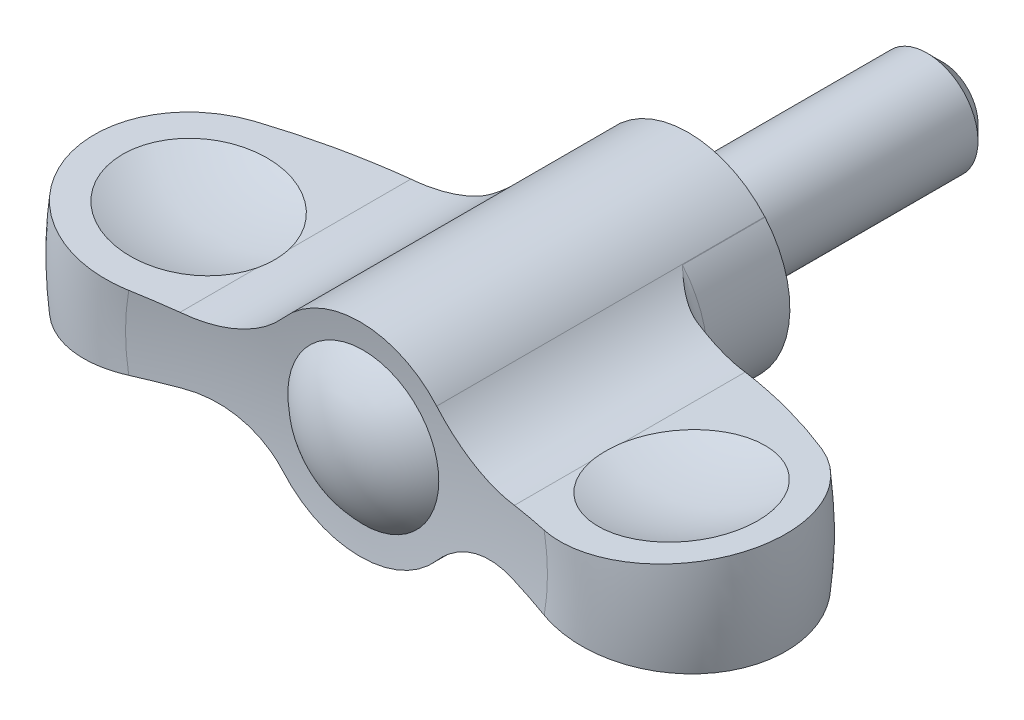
ISO-10303-21;
HEADER;
FILE_DESCRIPTION(('STEP AP214'),'2;1');
FILE_NAME('part.step','',(''),(''),'','','');
FILE_SCHEMA(('AUTOMOTIVE_DESIGN { 1 0 10303 214 1 1 1 1 }'));
ENDSEC;
DATA;
#1=APPLICATION_CONTEXT('core data for automotive mechanical design processes');
#2=APPLICATION_PROTOCOL_DEFINITION('international standard','automotive_design',2000,#1);
#3=PRODUCT_CONTEXT('',#1,'mechanical');
#4=PRODUCT('Part','Part','',(#3));
#5=PRODUCT_RELATED_PRODUCT_CATEGORY('part','',(#4));
#6=PRODUCT_DEFINITION_FORMATION('','',#4);
#7=PRODUCT_DEFINITION_CONTEXT('part definition',#1,'design');
#8=PRODUCT_DEFINITION('design','',#6,#7);
#9=PRODUCT_DEFINITION_SHAPE('','',#8);
#10=(LENGTH_UNIT() NAMED_UNIT(*) SI_UNIT(.MILLI.,.METRE.));
#11=(NAMED_UNIT(*) PLANE_ANGLE_UNIT() SI_UNIT($,.RADIAN.));
#12=(NAMED_UNIT(*) SI_UNIT($,.STERADIAN.) SOLID_ANGLE_UNIT());
#13=UNCERTAINTY_MEASURE_WITH_UNIT(LENGTH_MEASURE(1.E-05),#10,'distance_accuracy_value','');
#14=(GEOMETRIC_REPRESENTATION_CONTEXT(3) GLOBAL_UNCERTAINTY_ASSIGNED_CONTEXT((#13)) GLOBAL_UNIT_ASSIGNED_CONTEXT((#10,
#11,#12)) REPRESENTATION_CONTEXT('',''));
#15=CARTESIAN_POINT('',(0.,0.,0.));
#16=DIRECTION('',(0.,0.,1.));
#17=DIRECTION('',(1.,0.,0.));
#18=AXIS2_PLACEMENT_3D('',#15,#16,#17);
#19=CARTESIAN_POINT('',(0.,0.,6.5));
#20=DIRECTION('',(0.,0.,1.));
#21=DIRECTION('',(0.,-1.,0.));
#22=AXIS2_PLACEMENT_3D('',#19,#20,#21);
#23=TOROIDAL_SURFACE('',#22,9.4,1.40000000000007);
#24=DIRECTION('',(0.,0.,1.));
#25=VECTOR('',#24,1.);
#26=CARTESIAN_POINT('',(6.03890778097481,-5.2470556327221,-27.0219637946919));
#27=LINE('',#26,#25);
#28=CARTESIAN_POINT('',(6.03890778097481,-5.24705563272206,6.5));
#29=VERTEX_POINT('',#28);
#30=CARTESIAN_POINT('',(6.03890778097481,-5.2470556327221,6.50212008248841));
#31=VERTEX_POINT('',#30);
#32=EDGE_CURVE('E178',#29,#31,#27,.T.);
#33=ORIENTED_EDGE('',*,*,#32,.F.);
#34=CARTESIAN_POINT('',(0.,0.,6.5));
#35=DIRECTION('',(0.,0.,1.));
#36=DIRECTION('',(0.,-1.,0.));
#37=AXIS2_PLACEMENT_3D('',#34,#35,#36);
#38=CIRCLE('',#37,8.);
#39=CARTESIAN_POINT('',(6.0470062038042,5.23772049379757,6.4999999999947));
#40=VERTEX_POINT('',#39);
#41=EDGE_CURVE('E299',#29,#40,#38,.T.);
#42=ORIENTED_EDGE('',*,*,#41,.T.);
#43=CARTESIAN_POINT('',(8.59708199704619,3.29504177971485,7.88661989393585));
#44=CARTESIAN_POINT('',(8.50944178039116,3.33729136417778,7.87729621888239));
#45=CARTESIAN_POINT('',(8.42307614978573,3.38091432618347,7.8634831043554));
#46=CARTESIAN_POINT('',(8.25334791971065,3.47048341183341,7.82827393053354));
#47=CARTESIAN_POINT('',(8.16997966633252,3.51642472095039,7.80689307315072));
#48=CARTESIAN_POINT('',(8.00692725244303,3.61004558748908,7.75806975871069));
#49=CARTESIAN_POINT('',(7.9272211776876,3.65771052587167,7.73067131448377));
#50=CARTESIAN_POINT('',(7.77086822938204,3.75487699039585,7.67078020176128));
#51=CARTESIAN_POINT('',(7.69422278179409,3.80437935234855,7.6382851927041));
#52=CARTESIAN_POINT('',(7.51481068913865,3.92457245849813,7.55570149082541));
#53=CARTESIAN_POINT('',(7.41345025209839,3.99603060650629,7.50367899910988));
#54=CARTESIAN_POINT('',(7.21620642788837,4.14190058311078,7.39355525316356));
#55=CARTESIAN_POINT('',(7.12032815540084,4.21631506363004,7.33544846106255));
#56=CARTESIAN_POINT('',(6.89765495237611,4.39723051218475,7.19147911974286));
#57=CARTESIAN_POINT('',(6.77323076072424,4.50501816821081,7.10356810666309));
#58=CARTESIAN_POINT('',(6.57394920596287,4.68848676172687,6.95337103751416));
#59=CARTESIAN_POINT('',(6.49659267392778,4.76265888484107,6.89250585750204));
#60=CARTESIAN_POINT('',(6.37240043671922,4.88658090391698,6.79132557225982));
#61=CARTESIAN_POINT('',(6.32451434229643,4.93561192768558,6.75141880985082));
#62=CARTESIAN_POINT('',(6.24744938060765,5.01656740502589,6.68590586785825));
#63=CARTESIAN_POINT('',(6.217842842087,5.04817964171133,6.66041557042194));
#64=CARTESIAN_POINT('',(6.17012030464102,5.09997024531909,6.61881307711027));
#65=CARTESIAN_POINT('',(6.15183084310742,5.12002285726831,6.60274326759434));
#66=CARTESIAN_POINT('',(6.12231217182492,5.15271930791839,6.57655539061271));
#67=CARTESIAN_POINT('',(6.11100884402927,5.16531979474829,6.56646663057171));
#68=CARTESIAN_POINT('',(6.09275021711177,5.1858038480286,6.54999067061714));
#69=CARTESIAN_POINT('',(6.08575717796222,5.19368060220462,6.54363714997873));
#70=CARTESIAN_POINT('',(6.07446460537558,5.20645064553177,6.53319636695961));
#71=CARTESIAN_POINT('',(6.07013806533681,5.21135545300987,6.52915239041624));
#72=CARTESIAN_POINT('',(6.06316395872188,5.21928103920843,6.522425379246));
#73=CARTESIAN_POINT('',(6.06049083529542,5.22232358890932,6.51979601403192));
#74=CARTESIAN_POINT('',(6.05620285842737,5.22721145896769,6.51533355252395));
#75=CARTESIAN_POINT('',(6.05455913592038,5.22908696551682,6.5135617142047));
#76=CARTESIAN_POINT('',(6.05194270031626,5.23207504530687,6.51046552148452));
#77=CARTESIAN_POINT('',(6.05093886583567,5.23322217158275,6.50920550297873));
#78=CARTESIAN_POINT('',(6.04952852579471,5.2348346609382,6.50714224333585));
#79=CARTESIAN_POINT('',(6.04907130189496,5.23535757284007,6.5064196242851));
#80=CARTESIAN_POINT('',(6.04823146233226,5.23631829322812,6.50488003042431));
#81=CARTESIAN_POINT('',(6.04784824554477,5.23675678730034,6.50406390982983));
#82=CARTESIAN_POINT('',(6.04743475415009,5.23722999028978,6.50282878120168));
#83=CARTESIAN_POINT('',(6.04733123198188,5.2373484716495,6.50246832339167));
#84=CARTESIAN_POINT('',(6.04716301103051,5.23754100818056,6.50172769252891));
#85=CARTESIAN_POINT('',(6.04709815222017,5.2376152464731,6.50134760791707));
#86=CARTESIAN_POINT('',(6.04703697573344,5.23768527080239,6.5007703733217));
#87=CARTESIAN_POINT('',(6.04702259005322,5.2377017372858,6.50057747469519));
#88=CARTESIAN_POINT('',(6.04700608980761,5.23772062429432,6.50018965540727));
#89=CARTESIAN_POINT('',(6.04700402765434,5.23772298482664,6.49999472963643));
#90=CARTESIAN_POINT('',(6.04700841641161,5.23771796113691,6.49979999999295));
#91=B_SPLINE_CURVE_WITH_KNOTS('',3,(#43,#44,#45,#46,#47,#48,#49,#50,#51,#52,#53,#54,#55,#56,#57,
#58,#59,#60,#61,#62,#63,#64,#65,#66,#67,#68,#69,#70,#71,#72,#73,#74,#75,#76,#77,#78,#79,#80,#81,
#82,#83,#84,#85,#86,#87,#88,#89,#90),.UNSPECIFIED.,.F.,.F.,(4,2,2,2,2,2,2,2,2,2,2,2,2,2,2,2,2,2,
2,2,2,2,2,4),(0.,0.292919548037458,0.58525399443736,0.875517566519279,1.16591483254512,
1.56900991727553,1.97247513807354,2.53185645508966,2.90152662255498,3.1394263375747,
3.29018867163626,3.38481100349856,3.44392835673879,3.48083041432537,3.50389909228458,
3.51838177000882,3.52755772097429,3.53347737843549,3.53648190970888,3.53946090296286,
3.54063718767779,3.54180856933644,3.54239014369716,3.5429741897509),.UNSPECIFIED.);
#92=CARTESIAN_POINT('',(8.59520200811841,3.29594858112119,7.88641989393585));
#93=VERTEX_POINT('',#92);
#94=EDGE_CURVE('E445',#93,#40,#91,.T.);
#95=ORIENTED_EDGE('',*,*,#94,.F.);
#96=CARTESIAN_POINT('',(0.,0.,7.88641989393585));
#97=DIRECTION('',(0.,0.,1.));
#98=DIRECTION('',(0.,-1.,0.));
#99=AXIS2_PLACEMENT_3D('',#96,#97,#98);
#100=CIRCLE('',#99,9.20547525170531);
#101=CARTESIAN_POINT('',(8.59545916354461,-3.29527789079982,7.88641989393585));
#102=VERTEX_POINT('',#101);
#103=EDGE_CURVE('E300',#102,#93,#100,.T.);
#104=ORIENTED_EDGE('',*,*,#103,.F.);
#105=CARTESIAN_POINT('',(9.2464198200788,-3.01597169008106,7.86154869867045));
#106=CARTESIAN_POINT('',(9.19170321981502,-3.036626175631,7.87246212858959));
#107=CARTESIAN_POINT('',(9.13683292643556,-3.05803382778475,7.88088984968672));
#108=CARTESIAN_POINT('',(9.02721841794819,-3.10220967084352,7.89317258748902));
#109=CARTESIAN_POINT('',(8.97247413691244,-3.12497578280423,7.89703441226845));
#110=CARTESIAN_POINT('',(8.80995844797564,-3.19470660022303,7.90236716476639));
#111=CARTESIAN_POINT('',(8.70276195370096,-3.24353448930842,7.89779252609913));
#112=CARTESIAN_POINT('',(8.51047394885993,-3.33625869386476,7.87741400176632));
#113=CARTESIAN_POINT('',(8.42481297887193,-3.3795100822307,7.86372857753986));
#114=CARTESIAN_POINT('',(8.25627111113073,-3.46839491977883,7.82888132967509));
#115=CARTESIAN_POINT('',(8.17339149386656,-3.51402944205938,7.80771611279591));
#116=CARTESIAN_POINT('',(7.92832133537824,-3.65460006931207,7.73466741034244));
#117=CARTESIAN_POINT('',(7.77073045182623,-3.75270198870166,7.67337075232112));
#118=CARTESIAN_POINT('',(7.51219223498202,-3.92592329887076,7.55434149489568));
#119=CARTESIAN_POINT('',(7.40810830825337,-3.99942155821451,7.50076399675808));
#120=CARTESIAN_POINT('',(7.20573498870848,-4.14951628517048,7.38724676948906));
#121=CARTESIAN_POINT('',(7.10744753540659,-4.22611377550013,7.32730492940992));
#122=CARTESIAN_POINT('',(6.91648045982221,-4.38209339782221,7.20294133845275));
#123=CARTESIAN_POINT('',(6.82379096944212,-4.46147021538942,7.13852792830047));
#124=CARTESIAN_POINT('',(6.64338510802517,-4.62314447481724,7.00654560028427));
#125=CARTESIAN_POINT('',(6.55566785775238,-4.70544139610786,6.93897724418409));
#126=CARTESIAN_POINT('',(6.43300905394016,-4.82577735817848,6.84059313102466));
#127=CARTESIAN_POINT('',(6.39621820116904,-4.86258512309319,6.81055383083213));
#128=CARTESIAN_POINT('',(6.3234749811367,-4.93679114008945,6.75019039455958));
#129=CARTESIAN_POINT('',(6.28752259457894,-4.97418937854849,6.71986626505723));
#130=CARTESIAN_POINT('',(6.23420044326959,-5.03074553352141,6.67427938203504));
#131=CARTESIAN_POINT('',(6.21653276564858,-5.04966820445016,6.65907163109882));
#132=CARTESIAN_POINT('',(6.18141428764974,-5.08764734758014,6.62856921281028));
#133=CARTESIAN_POINT('',(6.16396349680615,-5.10670382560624,6.61327454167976));
#134=CARTESIAN_POINT('',(6.12918837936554,-5.1450544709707,6.58285648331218));
#135=CARTESIAN_POINT('',(6.11186402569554,-5.16434858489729,6.56773305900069));
#136=CARTESIAN_POINT('',(6.07769243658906,-5.20276831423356,6.53674407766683));
#137=CARTESIAN_POINT('',(6.06084502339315,-5.22189399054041,6.5208788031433));
#138=CARTESIAN_POINT('',(6.04125233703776,-5.24436286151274,6.50407138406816));
#139=CARTESIAN_POINT('',(6.03883132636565,-5.24714312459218,6.50202245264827));
#140=CARTESIAN_POINT('',(6.036402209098,-5.24993655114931,6.5));
#141=B_SPLINE_CURVE_WITH_KNOTS('',3,(#105,#106,#107,#108,#109,#110,#111,#112,#113,#114,#115,
#116,#117,#118,#119,#120,#121,#122,#123,#124,#125,#126,#127,#128,#129,#130,#131,#132,#133,#134,
#135,#136,#137,#138,#139,#140),.UNSPECIFIED.,.F.,.F.,(4,2,2,2,2,2,2,2,2,2,2,2,2,2,2,2,2,4),(0.,
0.178341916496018,0.356417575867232,0.708892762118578,0.99932106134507,1.2898812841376,
1.87442815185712,2.28884312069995,2.70339597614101,3.11719533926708,3.53092130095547,
3.71118323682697,3.89144102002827,3.98151493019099,4.07159278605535,4.16165075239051,
4.25167469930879,4.26432797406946),.UNSPECIFIED.);
#142=EDGE_CURVE('E316',#31,#102,#141,.F.);
#143=ORIENTED_EDGE('',*,*,#142,.F.);
#144=EDGE_LOOP('',(#33,#42,#95,#104,#143));
#145=FACE_BOUND('',#144,.T.);
#146=ADVANCED_FACE('F14',(#145),#23,.F.);
#147=CARTESIAN_POINT('',(7.9999999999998,0.,0.));
#148=DIRECTION('',(0.,0.,-1.));
#149=DIRECTION('',(0.,1.,0.));
#150=AXIS2_PLACEMENT_3D('',#147,#148,#149);
#151=PLANE('',#150);
#152=CARTESIAN_POINT('',(0.,0.,0.));
#153=DIRECTION('',(0.,0.,1.));
#154=DIRECTION('',(0.,-1.,0.));
#155=AXIS2_PLACEMENT_3D('',#152,#153,#154);
#156=CIRCLE('',#155,4.);
#157=CARTESIAN_POINT('',(0.,-4.,0.));
#158=VERTEX_POINT('',#157);
#159=EDGE_CURVE('E475',#158,#158,#156,.T.);
#160=ORIENTED_EDGE('',*,*,#159,.T.);
#161=EDGE_LOOP('',(#160));
#162=FACE_BOUND('',#161,.T.);
#163=CARTESIAN_POINT('',(12.0717114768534,10.5010774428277,0.));
#164=DIRECTION('',(0.,0.,-1.));
#165=DIRECTION('',(0.,1.,0.));
#166=AXIS2_PLACEMENT_3D('',#163,#164,#165);
#167=CIRCLE('',#166,8.);
#168=CARTESIAN_POINT('',(6.0470062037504,5.23772049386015,0.));
#169=VERTEX_POINT('',#168);
#170=CARTESIAN_POINT('',(6.02470527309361,5.26335694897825,0.));
#171=VERTEX_POINT('',#170);
#172=EDGE_CURVE('E454',#169,#171,#167,.T.);
#173=ORIENTED_EDGE('',*,*,#172,.F.);
#174=CARTESIAN_POINT('',(0.,0.,0.));
#175=DIRECTION('',(0.,0.,1.));
#176=DIRECTION('',(0.,-1.,0.));
#177=AXIS2_PLACEMENT_3D('',#174,#175,#176);
#178=CIRCLE('',#177,8.);
#179=CARTESIAN_POINT('',(-6.04700620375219,5.23772049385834,0.));
#180=VERTEX_POINT('',#179);
#181=EDGE_CURVE('E472',#180,#169,#178,.T.);
#182=ORIENTED_EDGE('',*,*,#181,.F.);
#183=CARTESIAN_POINT('',(-12.0717114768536,10.5010774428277,0.));
#184=DIRECTION('',(0.,0.,-1.));
#185=DIRECTION('',(0.,1.,0.));
#186=AXIS2_PLACEMENT_3D('',#183,#184,#185);
#187=CIRCLE('',#186,8.);
#188=CARTESIAN_POINT('',(-6.0247052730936,5.26335694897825,0.));
#189=VERTEX_POINT('',#188);
#190=EDGE_CURVE('E521',#180,#189,#187,.F.);
#191=ORIENTED_EDGE('',*,*,#190,.T.);
#192=EDGE_CURVE('E471',#171,#189,#178,.T.);
#193=ORIENTED_EDGE('',*,*,#192,.F.);
#194=EDGE_LOOP('',(#173,#182,#191,#193));
#195=FACE_BOUND('',#194,.T.);
#196=ADVANCED_FACE('F268',(#162,#195),#151,.T.);
#197=CARTESIAN_POINT('',(0.,0.,32.9780362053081));
#198=DIRECTION('',(0.,0.,1.));
#199=DIRECTION('',(0.,-1.,0.));
#200=AXIS2_PLACEMENT_3D('',#197,#198,#199);
#201=CYLINDRICAL_SURFACE('',#200,8.);
#202=DIRECTION('',(0.,0.,1.));
#203=VECTOR('',#202,1.);
#204=CARTESIAN_POINT('',(-6.0247052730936,5.26335694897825,-27.0219637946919));
#205=LINE('',#204,#203);
#206=CARTESIAN_POINT('',(-6.0247052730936,5.26335694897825,25.8131362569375));
#207=VERTEX_POINT('',#206);
#208=EDGE_CURVE('E162',#189,#207,#205,.T.);
#209=ORIENTED_EDGE('',*,*,#208,.T.);
#210=CARTESIAN_POINT('',(0.,0.,25.8131362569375));
#211=DIRECTION('',(0.,0.,1.));
#212=DIRECTION('',(0.,-1.,0.));
#213=AXIS2_PLACEMENT_3D('',#210,#211,#212);
#214=CIRCLE('',#213,8.);
#215=CARTESIAN_POINT('',(6.02470527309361,5.26335694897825,25.8131362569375));
#216=VERTEX_POINT('',#215);
#217=EDGE_CURVE('E477',#216,#207,#214,.T.);
#218=ORIENTED_EDGE('',*,*,#217,.F.);
#219=DIRECTION('',(0.,0.,1.));
#220=VECTOR('',#219,1.);
#221=CARTESIAN_POINT('',(6.02470527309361,5.26335694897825,-27.0219637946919));
#222=LINE('',#221,#220);
#223=EDGE_CURVE('E165',#171,#216,#222,.T.);
#224=ORIENTED_EDGE('',*,*,#223,.F.);
#225=ORIENTED_EDGE('',*,*,#192,.T.);
#226=EDGE_LOOP('',(#209,#218,#224,#225));
#227=FACE_BOUND('',#226,.T.);
#228=ADVANCED_FACE('F275',(#227),#201,.T.);
#229=DIRECTION('',(0.,0.,1.));
#230=VECTOR('',#229,1.);
#231=CARTESIAN_POINT('',(-6.04700620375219,5.23772049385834,3.25));
#232=LINE('',#231,#230);
#233=CARTESIAN_POINT('',(-6.0470062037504,5.23772049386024,6.5));
#234=VERTEX_POINT('',#233);
#235=EDGE_CURVE('E523',#180,#234,#232,.T.);
#236=ORIENTED_EDGE('',*,*,#235,.F.);
#237=ORIENTED_EDGE('',*,*,#181,.T.);
#238=DIRECTION('',(0.,0.,1.));
#239=VECTOR('',#238,1.);
#240=CARTESIAN_POINT('',(6.0470062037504,5.23772049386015,3.25));
#241=LINE('',#240,#239);
#242=EDGE_CURVE('E451',#169,#40,#241,.T.);
#243=ORIENTED_EDGE('',*,*,#242,.T.);
#244=ORIENTED_EDGE('',*,*,#41,.F.);
#245=ORIENTED_EDGE('',*,*,#32,.T.);
#246=CARTESIAN_POINT('',(6.03890778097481,-5.2470556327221,25.8131362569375));
#247=VERTEX_POINT('',#246);
#248=EDGE_CURVE('E175',#31,#247,#27,.T.);
#249=ORIENTED_EDGE('',*,*,#248,.T.);
#250=CARTESIAN_POINT('',(0.,0.,25.8131362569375));
#251=DIRECTION('',(0.,0.,1.));
#252=DIRECTION('',(0.,-1.,0.));
#253=AXIS2_PLACEMENT_3D('',#250,#251,#252);
#254=CIRCLE('',#253,8.);
#255=CARTESIAN_POINT('',(-6.03890778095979,-5.24705563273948,25.8131362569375));
#256=VERTEX_POINT('',#255);
#257=EDGE_CURVE('E304',#256,#247,#254,.T.);
#258=ORIENTED_EDGE('',*,*,#257,.F.);
#259=DIRECTION('',(0.,0.,1.));
#260=VECTOR('',#259,1.);
#261=CARTESIAN_POINT('',(-6.03890778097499,-5.2470556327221,-27.0219637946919));
#262=LINE('',#261,#260);
#263=CARTESIAN_POINT('',(-6.03890778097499,-5.2470556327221,6.50212008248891));
#264=VERTEX_POINT('',#263);
#265=EDGE_CURVE('E171',#264,#256,#262,.T.);
#266=ORIENTED_EDGE('',*,*,#265,.F.);
#267=CARTESIAN_POINT('',(-6.03890778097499,-5.24705563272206,6.5));
#268=VERTEX_POINT('',#267);
#269=EDGE_CURVE('E174',#268,#264,#262,.T.);
#270=ORIENTED_EDGE('',*,*,#269,.F.);
#271=EDGE_CURVE('E294',#234,#268,#38,.T.);
#272=ORIENTED_EDGE('',*,*,#271,.F.);
#273=EDGE_LOOP('',(#236,#237,#243,#244,#245,#249,#258,#266,#270,#272));
#274=FACE_BOUND('',#273,.T.);
#275=ADVANCED_FACE('F282',(#274),#201,.T.);
#276=ORIENTED_EDGE('',*,*,#271,.T.);
#277=ORIENTED_EDGE('',*,*,#269,.T.);
#278=CARTESIAN_POINT('',(-9.246419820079,-3.01597169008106,7.86154869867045));
#279=CARTESIAN_POINT('',(-9.19170321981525,-3.03662617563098,7.87246212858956));
#280=CARTESIAN_POINT('',(-9.13683292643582,-3.05803382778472,7.88088984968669));
#281=CARTESIAN_POINT('',(-9.02721841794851,-3.10220967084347,7.89317258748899));
#282=CARTESIAN_POINT('',(-8.97247413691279,-3.12497578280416,7.89703441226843));
#283=CARTESIAN_POINT('',(-8.80995844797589,-3.19470660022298,7.9023671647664));
#284=CARTESIAN_POINT('',(-8.70276195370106,-3.24353448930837,7.89779252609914));
#285=CARTESIAN_POINT('',(-8.51047394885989,-3.3362586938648,7.87741400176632));
#286=CARTESIAN_POINT('',(-8.42481297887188,-3.37951008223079,7.86372857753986));
#287=CARTESIAN_POINT('',(-8.25627111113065,-3.46839491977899,7.82888132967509));
#288=CARTESIAN_POINT('',(-8.17339149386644,-3.51402944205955,7.8077161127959));
#289=CARTESIAN_POINT('',(-7.92832133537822,-3.65460006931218,7.73466741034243));
#290=CARTESIAN_POINT('',(-7.77073045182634,-3.75270198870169,7.67337075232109));
#291=CARTESIAN_POINT('',(-7.51219223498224,-3.92592329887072,7.55434149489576));
#292=CARTESIAN_POINT('',(-7.40810830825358,-3.99942155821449,7.50076399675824));
#293=CARTESIAN_POINT('',(-7.20573498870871,-4.14951628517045,7.38724676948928));
#294=CARTESIAN_POINT('',(-7.10744753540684,-4.22611377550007,7.32730492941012));
#295=CARTESIAN_POINT('',(-6.91648045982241,-4.38209339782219,7.20294133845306));
#296=CARTESIAN_POINT('',(-6.82379096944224,-4.46147021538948,7.13852792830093));
#297=CARTESIAN_POINT('',(-6.64338510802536,-4.62314447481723,7.00654560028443));
#298=CARTESIAN_POINT('',(-6.5556678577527,-4.7054413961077,6.93897724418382));
#299=CARTESIAN_POINT('',(-6.43300905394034,-4.82577735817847,6.84059313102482));
#300=CARTESIAN_POINT('',(-6.39621820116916,-4.86258512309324,6.8105538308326));
#301=CARTESIAN_POINT('',(-6.32347498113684,-4.93679114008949,6.75019039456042));
#302=CARTESIAN_POINT('',(-6.28752259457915,-4.97418937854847,6.71986626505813));
#303=CARTESIAN_POINT('',(-6.23420044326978,-5.03074553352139,6.67427938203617));
#304=CARTESIAN_POINT('',(-6.21653276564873,-5.04966820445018,6.65907163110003));
#305=CARTESIAN_POINT('',(-6.18141428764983,-5.08764734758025,6.62856921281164));
#306=CARTESIAN_POINT('',(-6.16396349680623,-5.10670382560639,6.61327454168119));
#307=CARTESIAN_POINT('',(-6.1291883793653,-5.14505447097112,6.5828564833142));
#308=CARTESIAN_POINT('',(-6.11186402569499,-5.16434858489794,6.5677330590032));
#309=CARTESIAN_POINT('',(-6.07769243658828,-5.20276831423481,6.53674407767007));
#310=CARTESIAN_POINT('',(-6.06084502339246,-5.22189399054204,6.52087880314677));
#311=CARTESIAN_POINT('',(-6.04125233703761,-5.24436286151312,6.50407138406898));
#312=CARTESIAN_POINT('',(-6.03883132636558,-5.24714312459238,6.50202245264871));
#313=CARTESIAN_POINT('',(-6.036402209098,-5.2499365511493,6.5));
#314=B_SPLINE_CURVE_WITH_KNOTS('',3,(#278,#279,#280,#281,#282,#283,#284,#285,#286,#287,#288,
#289,#290,#291,#292,#293,#294,#295,#296,#297,#298,#299,#300,#301,#302,#303,#304,#305,#306,#307,
#308,#309,#310,#311,#312,#313),.UNSPECIFIED.,.F.,.F.,(4,2,2,2,2,2,2,2,2,2,2,2,2,2,2,2,2,4),(0.,
0.178341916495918,0.356417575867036,0.708892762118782,0.99932106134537,1.289881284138,
1.8744281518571,2.28884312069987,2.70339597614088,3.11719533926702,3.53092130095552,
3.71118323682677,3.89144102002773,3.98151493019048,4.07159278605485,4.16165075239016,
4.25167469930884,4.26432797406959),.UNSPECIFIED.);
#315=CARTESIAN_POINT('',(-8.59545916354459,-3.29527789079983,7.88641989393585));
#316=VERTEX_POINT('',#315);
#317=EDGE_CURVE('E311',#264,#316,#314,.F.);
#318=ORIENTED_EDGE('',*,*,#317,.T.);
#319=CARTESIAN_POINT('',(-8.5952020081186,3.29594858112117,7.88641989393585));
#320=VERTEX_POINT('',#319);
#321=EDGE_CURVE('E467',#320,#316,#100,.T.);
#322=ORIENTED_EDGE('',*,*,#321,.F.);
#323=CARTESIAN_POINT('',(-8.59708199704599,3.29504177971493,7.88661989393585));
#324=CARTESIAN_POINT('',(-8.50944178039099,3.33729136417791,7.87729621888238));
#325=CARTESIAN_POINT('',(-8.42307614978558,3.38091432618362,7.86348310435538));
#326=CARTESIAN_POINT('',(-8.2533479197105,3.47048341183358,7.82827393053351));
#327=CARTESIAN_POINT('',(-8.16997966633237,3.51642472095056,7.80689307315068));
#328=CARTESIAN_POINT('',(-8.00692725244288,3.61004558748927,7.75806975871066));
#329=CARTESIAN_POINT('',(-7.92722117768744,3.65771052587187,7.73067131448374));
#330=CARTESIAN_POINT('',(-7.77086822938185,3.75487699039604,7.67078020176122));
#331=CARTESIAN_POINT('',(-7.69422278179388,3.80437935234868,7.63828519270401));
#332=CARTESIAN_POINT('',(-7.51481068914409,3.92457245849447,7.55570149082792));
#333=CARTESIAN_POINT('',(-7.41345025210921,3.99603060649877,7.50367899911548));
#334=CARTESIAN_POINT('',(-7.21620642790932,4.14190058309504,7.39355525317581));
#335=CARTESIAN_POINT('',(-7.12032815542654,4.21631506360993,7.33544846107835));
#336=CARTESIAN_POINT('',(-6.89765495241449,4.39723051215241,7.19147911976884));
#337=CARTESIAN_POINT('',(-6.77323076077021,4.50501816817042,7.103568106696));
#338=CARTESIAN_POINT('',(-6.57394920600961,4.6884867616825,6.95337103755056));
#339=CARTESIAN_POINT('',(-6.49659267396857,4.76265888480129,6.89250585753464));
#340=CARTESIAN_POINT('',(-6.37240043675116,4.88658090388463,6.79132557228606));
#341=CARTESIAN_POINT('',(-6.32451434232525,4.93561192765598,6.75141880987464));
#342=CARTESIAN_POINT('',(-6.24744938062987,5.01656740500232,6.68590586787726));
#343=CARTESIAN_POINT('',(-6.21784284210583,5.04817964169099,6.66041557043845));
#344=CARTESIAN_POINT('',(-6.17012030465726,5.09997024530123,6.61881307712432));
#345=CARTESIAN_POINT('',(-6.15183084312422,5.12002285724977,6.60274326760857));
#346=CARTESIAN_POINT('',(-6.12231217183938,5.15271930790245,6.57655539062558));
#347=CARTESIAN_POINT('',(-6.11100884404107,5.16531979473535,6.56646663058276));
#348=CARTESIAN_POINT('',(-6.09275021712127,5.18580384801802,6.54999067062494));
#349=CARTESIAN_POINT('',(-6.08575717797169,5.19368060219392,6.54363714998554));
#350=CARTESIAN_POINT('',(-6.07446460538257,5.20645064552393,6.5331963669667));
#351=CARTESIAN_POINT('',(-6.07013806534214,5.21135545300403,6.52915239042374));
#352=CARTESIAN_POINT('',(-6.06316395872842,5.21928103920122,6.52242537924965));
#353=CARTESIAN_POINT('',(-6.06049083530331,5.22232358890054,6.51979601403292));
#354=CARTESIAN_POINT('',(-6.05620285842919,5.22721145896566,6.51533355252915));
#355=CARTESIAN_POINT('',(-6.05455913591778,5.22908696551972,6.51356171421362));
#356=CARTESIAN_POINT('',(-6.0519427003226,5.23207504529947,6.51046552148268));
#357=CARTESIAN_POINT('',(-6.05093886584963,5.23322217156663,6.50920550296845));
#358=CARTESIAN_POINT('',(-6.04952852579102,5.23483466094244,6.50714224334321));
#359=CARTESIAN_POINT('',(-6.04907130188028,5.235357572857,6.50641962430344));
#360=CARTESIAN_POINT('',(-6.04823146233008,5.23631829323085,6.50488003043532));
#361=CARTESIAN_POINT('',(-6.04784824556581,5.23675678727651,6.50406390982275));
#362=CARTESIAN_POINT('',(-6.04743475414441,5.23722999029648,6.50282878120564));
#363=CARTESIAN_POINT('',(-6.04733123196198,5.23734847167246,6.50246832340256));
#364=CARTESIAN_POINT('',(-6.04716301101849,5.23754100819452,6.50172769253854));
#365=CARTESIAN_POINT('',(-6.04709815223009,5.23761524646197,6.50134760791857));
#366=CARTESIAN_POINT('',(-6.04703697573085,5.23768527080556,6.50077037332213));
#367=CARTESIAN_POINT('',(-6.04702259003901,5.23770173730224,6.50057747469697));
#368=CARTESIAN_POINT('',(-6.04700608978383,5.23772062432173,6.5001896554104));
#369=CARTESIAN_POINT('',(-6.04700402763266,5.23772298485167,6.49999472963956));
#370=CARTESIAN_POINT('',(-6.0470084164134,5.23771796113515,6.49979999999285));
#371=B_SPLINE_CURVE_WITH_KNOTS('',3,(#323,#324,#325,#326,#327,#328,#329,#330,#331,#332,#333,
#334,#335,#336,#337,#338,#339,#340,#341,#342,#343,#344,#345,#346,#347,#348,#349,#350,#351,#352,
#353,#354,#355,#356,#357,#358,#359,#360,#361,#362,#363,#364,#365,#366,#367,#368,#369,#370),
.UNSPECIFIED.,.F.,.F.,(4,2,2,2,2,2,2,2,2,2,2,2,2,2,2,2,2,2,2,2,2,2,2,4),(0.,0.292919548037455,
0.585253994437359,0.875517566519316,1.16591483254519,1.56900991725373,1.97247513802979,
2.5318564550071,2.9015266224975,3.1394263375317,3.29018867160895,3.38481100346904,
3.44392835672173,3.48083041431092,3.5038990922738,3.51838177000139,3.52755772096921,
3.53347737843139,3.53648190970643,3.53946090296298,3.54063718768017,3.54180856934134,
3.54239014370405,3.54297418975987),.UNSPECIFIED.);
#372=EDGE_CURVE('E194',#320,#234,#371,.T.);
#373=ORIENTED_EDGE('',*,*,#372,.T.);
#374=EDGE_LOOP('',(#276,#277,#318,#322,#373));
#375=FACE_BOUND('',#374,.T.);
#376=ADVANCED_FACE('F270',(#375),#23,.F.);
#377=CARTESIAN_POINT('',(0.,0.,55.408674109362));
#378=DIRECTION('',(0.,0.,1.));
#379=DIRECTION('',(0.,-1.,0.));
#380=AXIS2_PLACEMENT_3D('',#377,#378,#379);
#381=DEGENERATE_TOROIDAL_SURFACE('',#380,2.53775894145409,47.9877389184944,.T.);
#382=ORIENTED_EDGE('',*,*,#103,.T.);
#383=CARTESIAN_POINT('',(5.40789714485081,6.07461400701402,7.74825077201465));
#384=CARTESIAN_POINT('',(5.5291773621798,5.89198502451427,7.7417150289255));
#385=CARTESIAN_POINT('',(5.65803975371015,5.71432205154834,7.7372582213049));
#386=CARTESIAN_POINT('',(5.92992964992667,5.37014226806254,7.7324895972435));
#387=CARTESIAN_POINT('',(6.07295642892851,5.2036248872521,7.73217756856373));
#388=CARTESIAN_POINT('',(6.37210580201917,4.88302009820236,7.73568398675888));
#389=CARTESIAN_POINT('',(6.52822111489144,4.72892587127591,7.73950015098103));
#390=CARTESIAN_POINT('',(6.85248447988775,4.43414479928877,7.75130368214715));
#391=CARTESIAN_POINT('',(7.02063240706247,4.29345781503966,7.75929100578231));
#392=CARTESIAN_POINT('',(7.36839276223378,4.02596374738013,7.77954568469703));
#393=CARTESIAN_POINT('',(7.54804576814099,3.89921061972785,7.79182895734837));
#394=CARTESIAN_POINT('',(7.9169239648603,3.66105266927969,7.82074605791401));
#395=CARTESIAN_POINT('',(8.10614934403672,3.54964814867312,7.83737997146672));
#396=CARTESIAN_POINT('',(8.49266533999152,3.34297499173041,7.87504105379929));
#397=CARTESIAN_POINT('',(8.68995161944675,3.24769781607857,7.89606588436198));
#398=CARTESIAN_POINT('',(9.09122637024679,3.07379499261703,7.94252339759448));
#399=CARTESIAN_POINT('',(9.29521479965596,2.99516924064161,7.96795605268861));
#400=CARTESIAN_POINT('',(9.70845663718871,2.854990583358,8.02319155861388));
#401=CARTESIAN_POINT('',(9.91771139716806,2.79344211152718,8.05299554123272));
#402=CARTESIAN_POINT('',(10.3400150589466,2.68771529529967,8.11688005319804));
#403=CARTESIAN_POINT('',(10.5530655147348,2.64354424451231,8.15096237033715));
#404=CARTESIAN_POINT('',(10.9815499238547,2.57272696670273,8.22326754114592));
#405=CARTESIAN_POINT('',(11.1969857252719,2.54609545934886,8.2614938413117));
#406=CARTESIAN_POINT('',(11.6284903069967,2.51043256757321,8.34184151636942));
#407=CARTESIAN_POINT('',(11.844558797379,2.50139409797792,8.38396131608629));
#408=CARTESIAN_POINT('',(12.2806577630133,2.50077046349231,8.47281848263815));
#409=CARTESIAN_POINT('',(12.5006723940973,2.50956853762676,8.51963625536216));
#410=CARTESIAN_POINT('',(12.9384709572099,2.54513800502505,8.6167995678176));
#411=CARTESIAN_POINT('',(13.156254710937,2.57191082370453,8.66714538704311));
#412=CARTESIAN_POINT('',(13.5879515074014,2.6430363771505,8.77098851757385));
#413=CARTESIAN_POINT('',(13.8018678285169,2.68737341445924,8.82448297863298));
#414=CARTESIAN_POINT('',(14.2246542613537,2.79313397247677,8.93430204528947));
#415=CARTESIAN_POINT('',(14.4335251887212,2.85455471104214,8.99062618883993));
#416=CARTESIAN_POINT('',(14.6392212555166,2.92427775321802,9.04819298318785));
#417=B_SPLINE_CURVE_WITH_KNOTS('',3,(#383,#384,#385,#386,#387,#388,#389,#390,#391,#392,#393,
#394,#395,#396,#397,#398,#399,#400,#401,#402,#403,#404,#405,#406,#407,#408,#409,#410,#411,#412,
#413,#414,#415,#416),.UNSPECIFIED.,.F.,.F.,(4,2,2,2,2,2,2,2,2,2,2,2,2,2,2,2,4),(0.,
0.657784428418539,1.31553517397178,1.9729224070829,2.63030281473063,3.2901452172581,
3.95000060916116,4.60950551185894,5.26900628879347,5.92867812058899,6.58862653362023,
7.24912809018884,7.90936359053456,8.58393530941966,9.25856052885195,9.93258417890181,
10.6064981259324),.UNSPECIFIED.);
#418=CARTESIAN_POINT('',(13.1528156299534,2.57446317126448,8.66701618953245));
#419=VERTEX_POINT('',#418);
#420=EDGE_CURVE('E438',#93,#419,#417,.T.);
#421=ORIENTED_EDGE('',*,*,#420,.T.);
#422=CARTESIAN_POINT('',(13.1526156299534,2.57444288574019,8.66696966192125));
#423=CARTESIAN_POINT('',(13.9370340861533,2.65400458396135,8.84943351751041));
#424=CARTESIAN_POINT('',(14.7168563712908,2.73310010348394,9.05185397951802));
#425=CARTESIAN_POINT('',(16.2633623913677,2.88995853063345,9.49546553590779));
#426=CARTESIAN_POINT('',(17.0300745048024,2.96772431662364,9.73655668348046));
#427=CARTESIAN_POINT('',(18.5504261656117,3.12192996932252,10.2573018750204));
#428=CARTESIAN_POINT('',(19.3040656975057,3.19836983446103,10.5369559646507));
#429=CARTESIAN_POINT('',(20.7982632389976,3.34992273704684,11.134858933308));
#430=CARTESIAN_POINT('',(21.5387829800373,3.4250318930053,11.4532044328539));
#431=CARTESIAN_POINT('',(22.2708092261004,3.49927957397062,11.7901956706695));
#432=B_SPLINE_CURVE_WITH_KNOTS('',3,(#422,#423,#424,#425,#426,#427,#428,#429,#430,#431),
.UNSPECIFIED.,.F.,.F.,(4,2,2,2,4),(0.,2.42758220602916,4.84898838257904,7.27039742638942,
9.69798251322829),.UNSPECIFIED.);
#433=CARTESIAN_POINT('',(22.2703747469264,3.49923550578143,11.7899956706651));
#434=VERTEX_POINT('',#433);
#435=EDGE_CURVE('E431',#419,#434,#432,.T.);
#436=ORIENTED_EDGE('',*,*,#435,.T.);
#437=CARTESIAN_POINT('',(0.,0.,11.7899956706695));
#438=DIRECTION('',(0.,0.,1.));
#439=DIRECTION('',(0.,-1.,0.));
#440=AXIS2_PLACEMENT_3D('',#437,#438,#439);
#441=CIRCLE('',#440,22.5436075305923);
#442=CARTESIAN_POINT('',(22.2706216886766,-3.49766351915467,11.7899956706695));
#443=VERTEX_POINT('',#442);
#444=EDGE_CURVE('E464',#443,#434,#441,.T.);
#445=ORIENTED_EDGE('',*,*,#444,.F.);
#446=CARTESIAN_POINT('',(12.9962083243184,-2.55398166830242,8.63065853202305));
#447=CARTESIAN_POINT('',(13.7943446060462,-2.63519292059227,8.81347846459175));
#448=CARTESIAN_POINT('',(14.5877985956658,-2.71592774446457,9.01694513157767));
#449=CARTESIAN_POINT('',(16.1611919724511,-2.87602226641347,9.46398142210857));
#450=CARTESIAN_POINT('',(16.9411614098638,-2.95538502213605,9.70744418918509));
#451=CARTESIAN_POINT('',(18.4876557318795,-3.11274253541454,10.2342505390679));
#452=CARTESIAN_POINT('',(19.2541805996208,-3.19073729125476,10.5175941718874));
#453=CARTESIAN_POINT('',(20.7737763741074,-3.34535784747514,11.1241962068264));
#454=CARTESIAN_POINT('',(21.5268064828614,-3.42197949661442,11.4475578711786));
#455=CARTESIAN_POINT('',(22.271056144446,-3.4977077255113,11.7901956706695));
#456=B_SPLINE_CURVE_WITH_KNOTS('',3,(#446,#447,#448,#449,#450,#451,#452,#453,#454,#455),
.UNSPECIFIED.,.F.,.F.,(4,2,2,2,4),(0.,2.46819948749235,4.92990890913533,7.3916214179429,
9.85982400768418),.UNSPECIFIED.);
#457=CARTESIAN_POINT('',(12.9964083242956,-2.5540020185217,8.63070434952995));
#458=VERTEX_POINT('',#457);
#459=EDGE_CURVE('E414',#458,#443,#456,.T.);
#460=ORIENTED_EDGE('',*,*,#459,.F.);
#461=CARTESIAN_POINT('',(5.40816196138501,-6.0746786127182,7.7482771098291));
#462=CARTESIAN_POINT('',(5.52938177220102,-5.89205626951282,7.74173743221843));
#463=CARTESIAN_POINT('',(5.65818351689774,-5.7143974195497,7.73727619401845));
#464=CARTESIAN_POINT('',(5.92995209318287,-5.37022086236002,7.73249766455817));
#465=CARTESIAN_POINT('',(6.07291819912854,-5.20370258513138,7.7321801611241));
#466=CARTESIAN_POINT('',(6.37194671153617,-4.88309096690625,7.73567453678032));
#467=CARTESIAN_POINT('',(6.52800183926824,-4.72899081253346,7.73948413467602));
#468=CARTESIAN_POINT('',(6.85214571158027,-4.43419295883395,7.75127335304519));
#469=CARTESIAN_POINT('',(7.02023433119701,-4.29349512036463,7.75925293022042));
#470=CARTESIAN_POINT('',(7.36787685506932,-4.02597472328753,7.77949081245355));
#471=CARTESIAN_POINT('',(7.54747132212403,-3.89920607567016,7.79176502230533));
#472=CARTESIAN_POINT('',(7.91623418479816,-3.66101233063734,7.82066267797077));
#473=CARTESIAN_POINT('',(8.10540276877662,-3.54958753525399,7.83728620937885));
#474=CARTESIAN_POINT('',(8.49180737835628,-3.34286928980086,7.87492522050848));
#475=CARTESIAN_POINT('',(8.68903906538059,-3.24756730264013,7.89593836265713));
#476=CARTESIAN_POINT('',(9.09020720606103,-3.0736105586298,7.94237123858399));
#477=CARTESIAN_POINT('',(9.29414361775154,-2.99495569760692,7.96779094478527));
#478=CARTESIAN_POINT('',(9.70728411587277,-2.85471488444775,8.02299934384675));
#479=CARTESIAN_POINT('',(9.91648954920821,-2.79313334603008,8.05278916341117));
#480=CARTESIAN_POINT('',(10.3386977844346,-2.68733665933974,8.11664426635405));
#481=CARTESIAN_POINT('',(10.5517021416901,-2.6431288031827,8.15071133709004));
#482=CARTESIAN_POINT('',(10.980097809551,-2.57223450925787,8.22298504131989));
#483=CARTESIAN_POINT('',(11.1954909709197,-2.5455627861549,8.26119511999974));
#484=CARTESIAN_POINT('',(11.6269140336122,-2.50981645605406,8.34150952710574));
#485=CARTESIAN_POINT('',(11.8429436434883,-2.50073476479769,8.38361228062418));
#486=CARTESIAN_POINT('',(12.2789655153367,-2.50002106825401,8.4724337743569));
#487=CARTESIAN_POINT('',(12.4989420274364,-2.50877204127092,8.51923286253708));
#488=CARTESIAN_POINT('',(12.9366686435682,-2.5442445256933,8.61635812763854));
#489=CARTESIAN_POINT('',(13.1544185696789,-2.57096746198,8.66668458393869));
#490=CARTESIAN_POINT('',(13.5860522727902,-2.6419909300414,8.77048849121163));
#491=CARTESIAN_POINT('',(13.7999393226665,-2.68627577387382,8.82396309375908));
#492=CARTESIAN_POINT('',(14.2226717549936,-2.79192997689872,8.93374204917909));
#493=CARTESIAN_POINT('',(14.4315179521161,-2.85329655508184,8.99004594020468));
#494=CARTESIAN_POINT('',(14.6371915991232,-2.92296463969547,9.04759234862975));
#495=B_SPLINE_CURVE_WITH_KNOTS('',3,(#461,#462,#463,#464,#465,#466,#467,#468,#469,#470,#471,
#472,#473,#474,#475,#476,#477,#478,#479,#480,#481,#482,#483,#484,#485,#486,#487,#488,#489,#490,
#491,#492,#493,#494),.UNSPECIFIED.,.F.,.F.,(4,2,2,2,2,2,2,2,2,2,2,2,2,2,2,2,4),(0.,
0.657668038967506,1.31530240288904,1.97257345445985,2.62983768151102,3.28956225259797,
3.9492998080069,4.60868692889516,5.26806992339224,5.92762322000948,6.58745305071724,
7.24783584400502,7.90795261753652,8.5823955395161,9.2568919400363,9.93078716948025,
10.6045727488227),.UNSPECIFIED.);
#496=EDGE_CURVE('E314',#458,#102,#495,.F.);
#497=ORIENTED_EDGE('',*,*,#496,.T.);
#498=EDGE_LOOP('',(#382,#421,#436,#445,#460,#497));
#499=FACE_BOUND('',#498,.T.);
#500=ADVANCED_FACE('F281',(#499),#381,.T.);
#501=CARTESIAN_POINT('',(0.,0.,19.5161101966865));
#502=DIRECTION('',(0.,0.,1.));
#503=DIRECTION('',(0.,-1.,0.));
#504=AXIS2_PLACEMENT_3D('',#501,#502,#503);
#505=TOROIDAL_SURFACE('',#504,19.,8.5);
#506=CARTESIAN_POINT('',(0.,0.,27.6698599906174));
#507=DIRECTION('',(0.,0.,1.));
#508=DIRECTION('',(0.,-1.,0.));
#509=AXIS2_PLACEMENT_3D('',#506,#507,#508);
#510=CIRCLE('',#509,16.5986744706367);
#511=CARTESIAN_POINT('',(16.3443249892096,-2.89465625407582,27.6698599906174));
#512=VERTEX_POINT('',#511);
#513=CARTESIAN_POINT('',(16.3437132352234,2.89810832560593,27.6698599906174));
#514=VERTEX_POINT('',#513);
#515=EDGE_CURVE('E460',#512,#514,#510,.T.);
#516=ORIENTED_EDGE('',*,*,#515,.F.);
#517=CARTESIAN_POINT('',(22.2701871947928,-3.49761930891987,11.7897956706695));
#518=CARTESIAN_POINT('',(22.4865890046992,-3.51963843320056,11.8893708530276));
#519=CARTESIAN_POINT('',(22.6987916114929,-3.54123028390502,11.9981566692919));
#520=CARTESIAN_POINT('',(23.1133331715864,-3.5834103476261,12.2332797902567));
#521=CARTESIAN_POINT('',(23.3156725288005,-3.60399860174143,12.359616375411));
#522=CARTESIAN_POINT('',(23.7089103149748,-3.64401098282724,12.6288905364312));
#523=CARTESIAN_POINT('',(23.8998162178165,-3.66343587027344,12.771817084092));
#524=CARTESIAN_POINT('',(24.2689734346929,-3.70099802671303,13.0733193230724));
#525=CARTESIAN_POINT('',(24.4472249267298,-3.71913531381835,13.2318947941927));
#526=CARTESIAN_POINT('',(24.7898897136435,-3.75400183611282,13.5636589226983));
#527=CARTESIAN_POINT('',(24.9542960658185,-3.77073036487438,13.7368548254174));
#528=CARTESIAN_POINT('',(25.2679995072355,-3.80265003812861,14.0965647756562));
#529=CARTESIAN_POINT('',(25.4172963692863,-3.81784115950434,14.2830790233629));
#530=CARTESIAN_POINT('',(25.6996801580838,-3.84657402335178,14.6680564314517));
#531=CARTESIAN_POINT('',(25.8327705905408,-3.86011612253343,14.8665169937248));
#532=CARTESIAN_POINT('',(26.0818270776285,-3.88545789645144,15.2740114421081));
#533=CARTESIAN_POINT('',(26.1977932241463,-3.89725758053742,15.4830452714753));
#534=CARTESIAN_POINT('',(26.4116662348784,-3.91901939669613,15.9099873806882));
#535=CARTESIAN_POINT('',(26.5095909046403,-3.92898334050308,16.1278866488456));
#536=CARTESIAN_POINT('',(26.6868542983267,-3.9470200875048,16.5712819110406));
#537=CARTESIAN_POINT('',(26.7661865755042,-3.95509223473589,16.7967805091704));
#538=CARTESIAN_POINT('',(26.9056523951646,-3.96928303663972,17.2536913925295));
#539=CARTESIAN_POINT('',(26.9657864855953,-3.97540174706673,17.4851035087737));
#540=CARTESIAN_POINT('',(27.0664298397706,-3.98564232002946,17.9522037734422));
#541=CARTESIAN_POINT('',(27.1069388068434,-3.98976415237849,18.1878919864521));
#542=CARTESIAN_POINT('',(27.1680180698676,-3.99597903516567,18.6616856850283));
#543=CARTESIAN_POINT('',(27.1886032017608,-3.99807359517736,18.8997892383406));
#544=CARTESIAN_POINT('',(27.2097404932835,-4.00022433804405,19.3768982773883));
#545=CARTESIAN_POINT('',(27.2102922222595,-4.00028047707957,19.6159037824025));
#546=CARTESIAN_POINT('',(27.1913600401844,-3.99835410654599,20.0930519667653));
#547=CARTESIAN_POINT('',(27.1718811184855,-3.99637210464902,20.331194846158));
#548=CARTESIAN_POINT('',(27.1130241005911,-3.99038333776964,20.8050668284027));
#549=CARTESIAN_POINT('',(27.0736391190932,-3.98637587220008,21.0407950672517));
#550=CARTESIAN_POINT('',(26.9752654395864,-3.97636624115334,21.5079930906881));
#551=CARTESIAN_POINT('',(26.9162837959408,-3.97036479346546,21.739464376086));
#552=CARTESIAN_POINT('',(26.7791326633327,-3.95640951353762,22.1965957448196));
#553=CARTESIAN_POINT('',(26.7009627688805,-3.94845564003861,22.4222557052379));
#554=CARTESIAN_POINT('',(26.5259936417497,-3.93065233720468,22.8661561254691));
#555=CARTESIAN_POINT('',(26.4291944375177,-3.92080291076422,23.0843965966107));
#556=CARTESIAN_POINT('',(26.2176548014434,-3.89927851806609,23.5119136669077));
#557=CARTESIAN_POINT('',(26.1029139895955,-3.88760351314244,23.7211900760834));
#558=CARTESIAN_POINT('',(25.8562793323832,-3.86250816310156,24.129341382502));
#559=CARTESIAN_POINT('',(25.7243811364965,-3.84908737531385,24.328213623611));
#560=CARTESIAN_POINT('',(25.4443947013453,-3.82059844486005,24.7140892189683));
#561=CARTESIAN_POINT('',(25.2963064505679,-3.8055303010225,24.9010925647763));
#562=CARTESIAN_POINT('',(24.9849941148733,-3.77385392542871,25.2619068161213));
#563=CARTESIAN_POINT('',(24.8217699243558,-3.75724568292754,25.4357176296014));
#564=CARTESIAN_POINT('',(24.4813524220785,-3.72260782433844,25.7689123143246));
#565=CARTESIAN_POINT('',(24.3041593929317,-3.70457823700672,25.9282964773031));
#566=CARTESIAN_POINT('',(23.9369192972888,-3.6672111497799,26.2316340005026));
#567=CARTESIAN_POINT('',(23.746862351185,-3.64787264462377,26.3755752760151));
#568=CARTESIAN_POINT('',(23.3553745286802,-3.60803832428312,26.6468659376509));
#569=CARTESIAN_POINT('',(23.1539438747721,-3.58754253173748,26.7742156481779));
#570=CARTESIAN_POINT('',(22.7410978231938,-3.5455349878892,27.0114526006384));
#571=CARTESIAN_POINT('',(22.5296804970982,-3.52402304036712,27.1213364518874));
#572=CARTESIAN_POINT('',(22.0984744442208,-3.48014734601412,27.3228052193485));
#573=CARTESIAN_POINT('',(21.8786886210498,-3.45778389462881,27.4143964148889));
#574=CARTESIAN_POINT('',(21.431905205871,-3.41232318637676,27.5788085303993));
#575=CARTESIAN_POINT('',(21.20489740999,-3.38922489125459,27.6516014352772));
#576=CARTESIAN_POINT('',(20.7455990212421,-3.34249077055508,27.7777299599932));
#577=CARTESIAN_POINT('',(20.5133085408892,-3.31885495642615,27.8310659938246));
#578=CARTESIAN_POINT('',(20.0450990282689,-3.27121411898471,27.9179123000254));
#579=CARTESIAN_POINT('',(19.8091801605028,-3.24720911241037,27.9514234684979));
#580=CARTESIAN_POINT('',(19.3353786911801,-3.19899928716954,27.998395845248));
#581=CARTESIAN_POINT('',(19.0974961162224,-3.17479447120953,28.0118573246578));
#582=CARTESIAN_POINT('',(18.6210318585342,-3.12631370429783,28.0186515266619));
#583=CARTESIAN_POINT('',(18.3824496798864,-3.10203770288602,28.0119491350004));
#584=CARTESIAN_POINT('',(17.9067737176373,-3.05363714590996,27.9784021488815));
#585=CARTESIAN_POINT('',(17.6696794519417,-3.02951254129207,27.9515644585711));
#586=CARTESIAN_POINT('',(17.1984347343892,-2.98156286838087,27.8779318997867));
#587=CARTESIAN_POINT('',(16.9642861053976,-2.95773798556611,27.8311252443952));
#588=CARTESIAN_POINT('',(16.500740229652,-2.91057167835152,27.7178937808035));
#589=CARTESIAN_POINT('',(16.2713428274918,-2.88723023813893,27.6514696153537));
#590=CARTESIAN_POINT('',(15.8183308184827,-2.84113576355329,27.4992830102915));
#591=CARTESIAN_POINT('',(15.5947326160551,-2.81838439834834,27.4134712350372));
#592=CARTESIAN_POINT('',(15.155526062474,-2.77369464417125,27.2232203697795));
#593=CARTESIAN_POINT('',(14.9399175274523,-2.75175623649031,27.1187817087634));
#594=CARTESIAN_POINT('',(14.5185439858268,-2.70888101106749,26.8921972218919));
#595=CARTESIAN_POINT('',(14.3127646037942,-2.68794273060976,26.7700783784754));
#596=CARTESIAN_POINT('',(13.9122402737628,-2.64718893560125,26.5089238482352));
#597=CARTESIAN_POINT('',(13.7174893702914,-2.62737281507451,26.3698974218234));
#598=CARTESIAN_POINT('',(13.4370604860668,-2.59883886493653,26.1513001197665));
#599=CARTESIAN_POINT('',(13.3466503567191,-2.58963953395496,26.077788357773));
#600=CARTESIAN_POINT('',(13.1690334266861,-2.57156681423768,25.9272071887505));
#601=CARTESIAN_POINT('',(13.081822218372,-2.56269297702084,25.8501430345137));
#602=CARTESIAN_POINT('',(12.9962083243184,-2.55398166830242,25.7713054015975));
#603=B_SPLINE_CURVE_WITH_KNOTS('',3,(#517,#518,#519,#520,#521,#522,#523,#524,#525,#526,#527,
#528,#529,#530,#531,#532,#533,#534,#535,#536,#537,#538,#539,#540,#541,#542,#543,#544,#545,#546,
#547,#548,#549,#550,#551,#552,#553,#554,#555,#556,#557,#558,#559,#560,#561,#562,#563,#564,#565,
#566,#567,#568,#569,#570,#571,#572,#573,#574,#575,#576,#577,#578,#579,#580,#581,#582,#583,#584,
#585,#586,#587,#588,#589,#590,#591,#592,#593,#594,#595,#596,#597,#598,#599,#600,#601,#602),
.UNSPECIFIED.,.F.,.F.,(4,2,2,2,2,2,2,2,2,2,2,2,2,2,2,2,2,2,2,2,2,2,2,2,2,2,2,2,2,2,2,2,2,2,2,2,
2,2,2,2,2,2,4),(0.,0.71746500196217,1.4349005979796,2.15186197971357,2.86881327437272,
3.58612197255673,4.30344145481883,5.02060549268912,5.73776568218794,6.45421425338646,
7.17091088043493,7.88758704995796,8.60427405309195,9.32042697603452,10.0365952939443,
10.7525852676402,11.4688230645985,12.1848033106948,12.9007986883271,13.6167929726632,
14.3328024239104,15.0489937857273,15.7651856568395,16.481382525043,17.1975649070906,
17.9143037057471,18.6310284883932,19.3478922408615,20.0645094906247,20.7821886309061,
21.4998524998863,22.2174839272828,22.9351056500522,23.6539777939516,24.3726035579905,
25.0916540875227,25.8106810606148,26.5315587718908,27.2524198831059,27.9721922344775,
28.691572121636,29.0421492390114,29.3922236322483),.UNSPECIFIED.);
#604=EDGE_CURVE('E409',#443,#512,#603,.T.);
#605=ORIENTED_EDGE('',*,*,#604,.F.);
#606=ORIENTED_EDGE('',*,*,#444,.T.);
#607=CARTESIAN_POINT('',(22.269940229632,3.49919143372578,11.7897956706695));
#608=CARTESIAN_POINT('',(22.4863520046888,3.52114156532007,11.8893700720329));
#609=CARTESIAN_POINT('',(22.6985645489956,3.54266577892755,11.9981550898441));
#610=CARTESIAN_POINT('',(23.1131258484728,3.58471374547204,12.2332767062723));
#611=CARTESIAN_POINT('',(23.3154750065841,3.60523753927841,12.3596125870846));
#612=CARTESIAN_POINT('',(23.7087322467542,3.64512468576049,12.6288856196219));
#613=CARTESIAN_POINT('',(23.8996477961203,3.66448879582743,12.7718117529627));
#614=CARTESIAN_POINT('',(24.2688239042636,3.70193345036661,13.0733134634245));
#615=CARTESIAN_POINT('',(24.4470846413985,3.72001401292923,13.2318888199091));
#616=CARTESIAN_POINT('',(24.7897674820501,3.75477151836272,13.563653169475));
#617=CARTESIAN_POINT('',(24.9541826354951,3.77144775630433,13.7368494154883));
#618=CARTESIAN_POINT('',(25.267902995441,3.80326766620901,14.0965604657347));
#619=CARTESIAN_POINT('',(25.417207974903,3.81841131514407,14.2830754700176));
#620=CARTESIAN_POINT('',(25.6996071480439,3.84705439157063,14.6680547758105));
#621=CARTESIAN_POINT('',(25.8327048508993,3.86055417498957,14.8665164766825));
#622=CARTESIAN_POINT('',(26.081774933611,3.88581676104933,15.2740136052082));
#623=CARTESIAN_POINT('',(26.1977474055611,3.89757957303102,15.4830489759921));
#624=CARTESIAN_POINT('',(26.4116306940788,3.91927324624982,15.9099919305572));
#625=CARTESIAN_POINT('',(26.5095595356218,3.92920593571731,16.1278903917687));
#626=CARTESIAN_POINT('',(26.6868305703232,3.94718611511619,16.571284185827));
#627=CARTESIAN_POINT('',(26.7661663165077,3.95523295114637,16.7967821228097));
#628=CARTESIAN_POINT('',(26.9056383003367,3.9693792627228,17.2536918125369));
#629=CARTESIAN_POINT('',(26.9657750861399,3.97547879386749,17.4851033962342));
#630=CARTESIAN_POINT('',(27.0664230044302,3.98568727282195,17.9522026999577));
#631=CARTESIAN_POINT('',(27.1069338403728,3.98979619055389,18.1878904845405));
#632=CARTESIAN_POINT('',(27.1680156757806,3.99599157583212,18.6616810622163));
#633=CARTESIAN_POINT('',(27.1886017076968,3.99807956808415,18.8997818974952));
#634=CARTESIAN_POINT('',(27.2097403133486,4.00022360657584,19.376885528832));
#635=CARTESIAN_POINT('',(27.2102924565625,4.00027960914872,19.6158883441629));
#636=CARTESIAN_POINT('',(27.1913606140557,3.99835939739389,20.0930311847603));
#637=CARTESIAN_POINT('',(27.1718816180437,3.99638368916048,20.3311714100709));
#638=CARTESIAN_POINT('',(27.1130239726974,3.99041389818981,20.8050381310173));
#639=CARTESIAN_POINT('',(27.0736384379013,3.98641911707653,21.0407637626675));
#640=CARTESIAN_POINT('',(26.9752633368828,3.97644116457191,21.5079559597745));
#641=CARTESIAN_POINT('',(26.9162808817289,3.97045871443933,21.7394240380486));
#642=CARTESIAN_POINT('',(26.7791278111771,3.95654760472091,22.1965491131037));
#643=CARTESIAN_POINT('',(26.7009567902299,3.94861890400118,22.4222059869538));
#644=CARTESIAN_POINT('',(26.5259851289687,3.93087194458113,22.8661004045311));
#645=CARTESIAN_POINT('',(26.4291845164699,3.92105368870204,23.0843379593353));
#646=CARTESIAN_POINT('',(26.217641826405,3.89959741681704,23.5118494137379));
#647=CARTESIAN_POINT('',(26.1028993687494,3.88795936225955,23.7211231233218));
#648=CARTESIAN_POINT('',(25.8562607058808,3.86294338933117,24.1292701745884));
#649=CARTESIAN_POINT('',(25.7243600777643,3.84956502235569,24.3281408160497));
#650=CARTESIAN_POINT('',(25.4443684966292,3.82116614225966,24.7140134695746));
#651=CARTESIAN_POINT('',(25.2962775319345,3.80614562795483,24.9010154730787));
#652=CARTESIAN_POINT('',(24.9849596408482,3.77456939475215,25.26182725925));
#653=CARTESIAN_POINT('',(24.821732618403,3.75801366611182,25.4356369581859));
#654=CARTESIAN_POINT('',(24.4813092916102,3.72348533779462,25.768829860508));
#655=CARTESIAN_POINT('',(24.3041132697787,3.70551276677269,25.9282133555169));
#656=CARTESIAN_POINT('',(23.9368653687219,3.66826368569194,26.2315514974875));
#657=CARTESIAN_POINT('',(23.7468034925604,3.64898616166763,26.3754939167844));
#658=CARTESIAN_POINT('',(23.3553055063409,3.60927745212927,26.6467872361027));
#659=CARTESIAN_POINT('',(23.1538696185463,3.58884628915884,26.7741384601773));
#660=CARTESIAN_POINT('',(22.7410119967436,3.54697112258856,27.0113794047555));
#661=CARTESIAN_POINT('',(22.5295882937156,3.5255269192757,27.1212656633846));
#662=CARTESIAN_POINT('',(22.0983691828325,3.48178939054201,27.3227397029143));
#663=CARTESIAN_POINT('',(21.8785766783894,3.45949635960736,27.414333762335));
#664=CARTESIAN_POINT('',(21.4317737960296,3.41417820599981,27.5787543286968));
#665=CARTESIAN_POINT('',(21.2047530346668,3.3911520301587,27.6515523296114));
#666=CARTESIAN_POINT('',(20.7454281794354,3.34456380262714,27.7776907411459));
#667=CARTESIAN_POINT('',(20.5131241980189,3.32100176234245,27.8310315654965));
#668=CARTESIAN_POINT('',(20.0448917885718,3.273510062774,27.9178864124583));
#669=CARTESIAN_POINT('',(19.808963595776,3.24958042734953,27.9514017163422));
#670=CARTESIAN_POINT('',(19.33514312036,3.20152194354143,27.9983830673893));
#671=CARTESIAN_POINT('',(19.09725086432,3.17739309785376,28.0118493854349));
#672=CARTESIAN_POINT('',(18.6207682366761,3.1290645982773,28.0186540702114));
#673=CARTESIAN_POINT('',(18.3821773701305,3.10486489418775,28.0119574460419));
#674=CARTESIAN_POINT('',(17.906483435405,3.05661638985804,27.9784231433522));
#675=CARTESIAN_POINT('',(17.6693798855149,3.03256754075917,27.951592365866));
#676=CARTESIAN_POINT('',(17.1980962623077,2.98476636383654,27.8779717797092));
#677=CARTESIAN_POINT('',(16.9639182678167,2.96101424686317,27.831168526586));
#678=CARTESIAN_POINT('',(16.5003145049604,2.91399201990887,27.7179420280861));
#679=CARTESIAN_POINT('',(16.2708885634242,2.89072189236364,27.6515194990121));
#680=CARTESIAN_POINT('',(15.8177881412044,2.84476499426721,27.4993238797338));
#681=CARTESIAN_POINT('',(15.594130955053,2.8220799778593,27.4134987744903));
#682=CARTESIAN_POINT('',(15.1548092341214,2.77752062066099,27.2232142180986));
#683=CARTESIAN_POINT('',(14.9391444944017,2.75564625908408,27.118755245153));
#684=CARTESIAN_POINT('',(14.5177209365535,2.71290226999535,26.892155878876));
#685=CARTESIAN_POINT('',(14.3119451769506,2.69203092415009,26.7700472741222));
#686=CARTESIAN_POINT('',(13.9114301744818,2.6514076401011,26.508917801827));
#687=CARTESIAN_POINT('',(13.7166843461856,2.63165503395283,26.3699071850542));
#688=CARTESIAN_POINT('',(13.4640710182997,2.60603306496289,26.1730131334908));
#689=CARTESIAN_POINT('',(13.4007037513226,2.59960587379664,26.1221461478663));
#690=CARTESIAN_POINT('',(13.2755127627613,2.58690804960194,26.0186683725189));
#691=CARTESIAN_POINT('',(13.2136874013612,2.58063725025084,25.9660595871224));
#692=CARTESIAN_POINT('',(13.1526156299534,2.57444288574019,25.9125680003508));
#693=B_SPLINE_CURVE_WITH_KNOTS('',3,(#607,#608,#609,#610,#611,#612,#613,#614,#615,#616,#617,
#618,#619,#620,#621,#622,#623,#624,#625,#626,#627,#628,#629,#630,#631,#632,#633,#634,#635,#636,
#637,#638,#639,#640,#641,#642,#643,#644,#645,#646,#647,#648,#649,#650,#651,#652,#653,#654,#655,
#656,#657,#658,#659,#660,#661,#662,#663,#664,#665,#666,#667,#668,#669,#670,#671,#672,#673,#674,
#675,#676,#677,#678,#679,#680,#681,#682,#683,#684,#685,#686,#687,#688,#689,#690,#691,#692),
.UNSPECIFIED.,.F.,.F.,(4,2,2,2,2,2,2,2,2,2,2,2,2,2,2,2,2,2,2,2,2,2,2,2,2,2,2,2,2,2,2,2,2,2,2,2,
2,2,2,2,2,2,4),(0.,0.717472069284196,1.43491480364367,2.15188374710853,2.8688425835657,
3.58615919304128,4.30348657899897,5.02065837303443,5.73782631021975,6.45427388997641,
7.17096952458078,7.88764469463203,8.60433069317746,9.3204755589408,10.0366358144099,
10.7526177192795,11.468847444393,12.1848175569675,12.9008028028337,13.6167869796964,
14.3327863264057,15.0489706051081,15.7651554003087,16.4813447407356,17.197519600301,
17.914257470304,18.6309813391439,19.3478470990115,20.0644663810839,20.7821661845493,
21.4998507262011,22.2174888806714,22.9351173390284,23.6539918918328,24.3726201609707,
25.0917329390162,25.8108194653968,26.5318570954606,27.2528762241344,27.9726125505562,
28.6919145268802,28.936425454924,29.1806641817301),.UNSPECIFIED.);
#694=EDGE_CURVE('E425',#434,#514,#693,.T.);
#695=ORIENTED_EDGE('',*,*,#694,.T.);
#696=EDGE_LOOP('',(#516,#605,#606,#695));
#697=FACE_BOUND('',#696,.T.);
#698=ADVANCED_FACE('F289',(#697),#505,.T.);
#699=CARTESIAN_POINT('',(-16.3437132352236,2.89810832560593,27.6698599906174));
#700=VERTEX_POINT('',#699);
#701=CARTESIAN_POINT('',(-16.3443249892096,-2.89465625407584,27.6698599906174));
#702=VERTEX_POINT('',#701);
#703=EDGE_CURVE('E459',#700,#702,#510,.T.);
#704=ORIENTED_EDGE('',*,*,#703,.F.);
#705=CARTESIAN_POINT('',(-22.269940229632,3.49919143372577,11.7897956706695));
#706=CARTESIAN_POINT('',(-22.4863520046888,3.52114156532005,11.8893700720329));
#707=CARTESIAN_POINT('',(-22.6985645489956,3.54266577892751,11.9981550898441));
#708=CARTESIAN_POINT('',(-23.1131258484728,3.584713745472,12.2332767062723));
#709=CARTESIAN_POINT('',(-23.3154750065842,3.60523753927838,12.3596125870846));
#710=CARTESIAN_POINT('',(-23.7087322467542,3.64512468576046,12.628885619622));
#711=CARTESIAN_POINT('',(-23.8996477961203,3.6644887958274,12.7718117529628));
#712=CARTESIAN_POINT('',(-24.2688239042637,3.70193345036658,13.0733134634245));
#713=CARTESIAN_POINT('',(-24.4470846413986,3.72001401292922,13.2318888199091));
#714=CARTESIAN_POINT('',(-24.7897674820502,3.7547715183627,13.5636531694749));
#715=CARTESIAN_POINT('',(-24.9541826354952,3.7714477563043,13.7368494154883));
#716=CARTESIAN_POINT('',(-25.267902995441,3.80326766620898,14.0965604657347));
#717=CARTESIAN_POINT('',(-25.4172079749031,3.81841131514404,14.2830754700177));
#718=CARTESIAN_POINT('',(-25.6996071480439,3.8470543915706,14.6680547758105));
#719=CARTESIAN_POINT('',(-25.8327048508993,3.86055417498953,14.8665164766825));
#720=CARTESIAN_POINT('',(-26.081774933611,3.88581676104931,15.2740136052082));
#721=CARTESIAN_POINT('',(-26.1977474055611,3.89757957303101,15.4830489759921));
#722=CARTESIAN_POINT('',(-26.4116306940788,3.9192732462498,15.9099919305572));
#723=CARTESIAN_POINT('',(-26.5095595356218,3.92920593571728,16.1278903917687));
#724=CARTESIAN_POINT('',(-26.6868305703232,3.94718611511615,16.571284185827));
#725=CARTESIAN_POINT('',(-26.7661663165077,3.95523295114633,16.7967821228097));
#726=CARTESIAN_POINT('',(-26.9056383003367,3.96937926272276,17.2536918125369));
#727=CARTESIAN_POINT('',(-26.9657750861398,3.97547879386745,17.4851033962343));
#728=CARTESIAN_POINT('',(-27.0664230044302,3.98568727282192,17.9522026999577));
#729=CARTESIAN_POINT('',(-27.1069338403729,3.98979619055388,18.1878904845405));
#730=CARTESIAN_POINT('',(-27.1680156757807,3.99599157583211,18.6616810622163));
#731=CARTESIAN_POINT('',(-27.1886017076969,3.99807956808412,18.8997818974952));
#732=CARTESIAN_POINT('',(-27.2097403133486,4.0002236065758,19.3768855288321));
#733=CARTESIAN_POINT('',(-27.2102924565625,4.00027960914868,19.6158883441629));
#734=CARTESIAN_POINT('',(-27.1913606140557,3.99835939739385,20.0930311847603));
#735=CARTESIAN_POINT('',(-27.1718816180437,3.99638368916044,20.331171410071));
#736=CARTESIAN_POINT('',(-27.1130239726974,3.99041389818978,20.8050381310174));
#737=CARTESIAN_POINT('',(-27.0736384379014,3.98641911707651,21.0407637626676));
#738=CARTESIAN_POINT('',(-26.9752633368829,3.97644116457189,21.5079559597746));
#739=CARTESIAN_POINT('',(-26.9162808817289,3.9704587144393,21.7394240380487));
#740=CARTESIAN_POINT('',(-26.779127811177,3.95654760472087,22.1965491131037));
#741=CARTESIAN_POINT('',(-26.7009567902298,3.94861890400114,22.4222059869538));
#742=CARTESIAN_POINT('',(-26.5259851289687,3.93087194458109,22.8661004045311));
#743=CARTESIAN_POINT('',(-26.4291845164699,3.921053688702,23.0843379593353));
#744=CARTESIAN_POINT('',(-26.217641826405,3.89959741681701,23.5118494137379));
#745=CARTESIAN_POINT('',(-26.1028993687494,3.88795936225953,23.7211231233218));
#746=CARTESIAN_POINT('',(-25.8562607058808,3.86294338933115,24.1292701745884));
#747=CARTESIAN_POINT('',(-25.7243600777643,3.84956502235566,24.3281408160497));
#748=CARTESIAN_POINT('',(-25.4443684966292,3.82116614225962,24.7140134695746));
#749=CARTESIAN_POINT('',(-25.2962775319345,3.80614562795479,24.9010154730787));
#750=CARTESIAN_POINT('',(-24.9849596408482,3.77456939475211,25.26182725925));
#751=CARTESIAN_POINT('',(-24.8217326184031,3.75801366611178,25.4356369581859));
#752=CARTESIAN_POINT('',(-24.4813092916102,3.72348533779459,25.768829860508));
#753=CARTESIAN_POINT('',(-24.3041132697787,3.70551276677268,25.9282133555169));
#754=CARTESIAN_POINT('',(-23.9368653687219,3.66826368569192,26.2315514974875));
#755=CARTESIAN_POINT('',(-23.7468034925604,3.6489861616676,26.3754939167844));
#756=CARTESIAN_POINT('',(-23.355305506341,3.60927745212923,26.6467872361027));
#757=CARTESIAN_POINT('',(-23.1538696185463,3.58884628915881,26.7741384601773));
#758=CARTESIAN_POINT('',(-22.7410119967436,3.54697112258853,27.0113794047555));
#759=CARTESIAN_POINT('',(-22.5295882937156,3.52552691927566,27.1212656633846));
#760=CARTESIAN_POINT('',(-22.0983691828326,3.48178939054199,27.3227397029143));
#761=CARTESIAN_POINT('',(-21.8785766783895,3.45949635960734,27.414333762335));
#762=CARTESIAN_POINT('',(-21.4317737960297,3.4141782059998,27.5787543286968));
#763=CARTESIAN_POINT('',(-21.2047530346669,3.39115203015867,27.6515523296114));
#764=CARTESIAN_POINT('',(-20.7454281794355,3.34456380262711,27.7776907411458));
#765=CARTESIAN_POINT('',(-20.513124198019,3.32100176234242,27.8310315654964));
#766=CARTESIAN_POINT('',(-20.0448917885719,3.27351006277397,27.9178864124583));
#767=CARTESIAN_POINT('',(-19.808963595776,3.2495804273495,27.9514017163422));
#768=CARTESIAN_POINT('',(-19.33514312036,3.20152194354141,27.9983830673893));
#769=CARTESIAN_POINT('',(-19.09725086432,3.17739309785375,28.0118493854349));
#770=CARTESIAN_POINT('',(-18.6207682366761,3.12906459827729,28.0186540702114));
#771=CARTESIAN_POINT('',(-18.3821773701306,3.10486489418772,28.0119574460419));
#772=CARTESIAN_POINT('',(-17.906483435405,3.056616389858,27.9784231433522));
#773=CARTESIAN_POINT('',(-17.669379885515,3.03256754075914,27.951592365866));
#774=CARTESIAN_POINT('',(-17.1980962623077,2.9847663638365,27.8779717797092));
#775=CARTESIAN_POINT('',(-16.9639182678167,2.96101424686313,27.831168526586));
#776=CARTESIAN_POINT('',(-16.5003145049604,2.91399201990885,27.7179420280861));
#777=CARTESIAN_POINT('',(-16.2708885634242,2.89072189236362,27.6515194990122));
#778=CARTESIAN_POINT('',(-15.8177881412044,2.8447649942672,27.4993238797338));
#779=CARTESIAN_POINT('',(-15.594130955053,2.82207997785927,27.4134987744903));
#780=CARTESIAN_POINT('',(-15.1548092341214,2.77752062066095,27.2232142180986));
#781=CARTESIAN_POINT('',(-14.9391444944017,2.75564625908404,27.118755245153));
#782=CARTESIAN_POINT('',(-14.5177209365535,2.71290226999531,26.892155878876));
#783=CARTESIAN_POINT('',(-14.3119451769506,2.69203092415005,26.7700472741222));
#784=CARTESIAN_POINT('',(-13.9114301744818,2.65140764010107,26.508917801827));
#785=CARTESIAN_POINT('',(-13.7166843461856,2.63165503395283,26.3699071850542));
#786=CARTESIAN_POINT('',(-13.4640710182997,2.60603306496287,26.1730131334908));
#787=CARTESIAN_POINT('',(-13.4007037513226,2.59960587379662,26.1221461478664));
#788=CARTESIAN_POINT('',(-13.2755127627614,2.58690804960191,26.0186683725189));
#789=CARTESIAN_POINT('',(-13.2136874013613,2.58063725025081,25.9660595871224));
#790=CARTESIAN_POINT('',(-13.1526156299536,2.57444288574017,25.9125680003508));
#791=B_SPLINE_CURVE_WITH_KNOTS('',3,(#705,#706,#707,#708,#709,#710,#711,#712,#713,#714,#715,
#716,#717,#718,#719,#720,#721,#722,#723,#724,#725,#726,#727,#728,#729,#730,#731,#732,#733,#734,
#735,#736,#737,#738,#739,#740,#741,#742,#743,#744,#745,#746,#747,#748,#749,#750,#751,#752,#753,
#754,#755,#756,#757,#758,#759,#760,#761,#762,#763,#764,#765,#766,#767,#768,#769,#770,#771,#772,
#773,#774,#775,#776,#777,#778,#779,#780,#781,#782,#783,#784,#785,#786,#787,#788,#789,#790),
.UNSPECIFIED.,.F.,.F.,(4,2,2,2,2,2,2,2,2,2,2,2,2,2,2,2,2,2,2,2,2,2,2,2,2,2,2,2,2,2,2,2,2,2,2,2,
2,2,2,2,2,2,4),(0.,0.717472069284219,1.43491480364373,2.1518837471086,2.86884258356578,
3.58615919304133,4.30348657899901,5.02065837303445,5.73782631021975,6.45427388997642,
7.1709695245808,7.88764469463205,8.60433069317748,9.32047555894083,10.0366358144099,
10.7526177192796,11.4688474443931,12.1848175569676,12.9008028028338,13.6167869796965,
14.3327863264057,15.0489706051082,15.7651554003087,16.4813447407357,17.197519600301,
17.914257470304,18.6309813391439,19.3478470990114,20.0644663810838,20.7821661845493,
21.4998507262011,22.2174888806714,22.9351173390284,23.6539918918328,24.3726201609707,
25.0917329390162,25.8108194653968,26.5318570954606,27.2528762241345,27.9726125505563,
28.6919145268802,28.9364254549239,29.18066418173),.UNSPECIFIED.);
#792=CARTESIAN_POINT('',(-22.2703747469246,3.49923550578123,11.7899956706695));
#793=VERTEX_POINT('',#792);
#794=EDGE_CURVE('E498',#793,#700,#791,.T.);
#795=ORIENTED_EDGE('',*,*,#794,.F.);
#796=CARTESIAN_POINT('',(-22.2706216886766,-3.49766351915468,11.7899956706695));
#797=VERTEX_POINT('',#796);
#798=EDGE_CURVE('E463',#793,#797,#441,.T.);
#799=ORIENTED_EDGE('',*,*,#798,.T.);
#800=CARTESIAN_POINT('',(-22.2701871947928,-3.49761930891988,11.7897956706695));
#801=CARTESIAN_POINT('',(-22.4865890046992,-3.51963843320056,11.8893708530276));
#802=CARTESIAN_POINT('',(-22.6987916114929,-3.54123028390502,11.9981566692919));
#803=CARTESIAN_POINT('',(-23.1133331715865,-3.5834103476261,12.2332797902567));
#804=CARTESIAN_POINT('',(-23.3156725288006,-3.60399860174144,12.359616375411));
#805=CARTESIAN_POINT('',(-23.7089103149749,-3.64401098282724,12.6288905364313));
#806=CARTESIAN_POINT('',(-23.8998162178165,-3.66343587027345,12.7718170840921));
#807=CARTESIAN_POINT('',(-24.268973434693,-3.70099802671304,13.0733193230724));
#808=CARTESIAN_POINT('',(-24.4472249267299,-3.71913531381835,13.2318947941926));
#809=CARTESIAN_POINT('',(-24.7898897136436,-3.75400183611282,13.5636589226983));
#810=CARTESIAN_POINT('',(-24.9542960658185,-3.77073036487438,13.7368548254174));
#811=CARTESIAN_POINT('',(-25.2679995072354,-3.80265003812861,14.0965647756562));
#812=CARTESIAN_POINT('',(-25.4172963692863,-3.81784115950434,14.2830790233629));
#813=CARTESIAN_POINT('',(-25.6996801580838,-3.84657402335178,14.6680564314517));
#814=CARTESIAN_POINT('',(-25.8327705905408,-3.86011612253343,14.8665169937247));
#815=CARTESIAN_POINT('',(-26.0818270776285,-3.88545789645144,15.2740114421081));
#816=CARTESIAN_POINT('',(-26.1977932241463,-3.89725758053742,15.4830452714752));
#817=CARTESIAN_POINT('',(-26.4116662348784,-3.91901939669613,15.9099873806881));
#818=CARTESIAN_POINT('',(-26.5095909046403,-3.92898334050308,16.1278866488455));
#819=CARTESIAN_POINT('',(-26.6868542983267,-3.94702008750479,16.5712819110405));
#820=CARTESIAN_POINT('',(-26.7661865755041,-3.95509223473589,16.7967805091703));
#821=CARTESIAN_POINT('',(-26.9056523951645,-3.96928303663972,17.2536913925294));
#822=CARTESIAN_POINT('',(-26.9657864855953,-3.97540174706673,17.4851035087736));
#823=CARTESIAN_POINT('',(-27.0664298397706,-3.98564232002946,17.9522037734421));
#824=CARTESIAN_POINT('',(-27.1069388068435,-3.98976415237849,18.187891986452));
#825=CARTESIAN_POINT('',(-27.1680180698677,-3.99597903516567,18.6616856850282));
#826=CARTESIAN_POINT('',(-27.1886032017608,-3.99807359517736,18.8997892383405));
#827=CARTESIAN_POINT('',(-27.2097404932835,-4.00022433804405,19.3768982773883));
#828=CARTESIAN_POINT('',(-27.2102922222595,-4.00028047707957,19.6159037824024));
#829=CARTESIAN_POINT('',(-27.1913600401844,-3.99835410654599,20.0930519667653));
#830=CARTESIAN_POINT('',(-27.1718811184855,-3.99637210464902,20.331194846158));
#831=CARTESIAN_POINT('',(-27.1130241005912,-3.99038333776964,20.8050668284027));
#832=CARTESIAN_POINT('',(-27.0736391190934,-3.98637587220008,21.0407950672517));
#833=CARTESIAN_POINT('',(-26.9752654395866,-3.97636624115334,21.5079930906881));
#834=CARTESIAN_POINT('',(-26.9162837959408,-3.97036479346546,21.739464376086));
#835=CARTESIAN_POINT('',(-26.7791326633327,-3.95640951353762,22.1965957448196));
#836=CARTESIAN_POINT('',(-26.7009627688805,-3.94845564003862,22.4222557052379));
#837=CARTESIAN_POINT('',(-26.5259936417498,-3.93065233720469,22.8661561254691));
#838=CARTESIAN_POINT('',(-26.4291944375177,-3.92080291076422,23.0843965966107));
#839=CARTESIAN_POINT('',(-26.2176548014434,-3.89927851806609,23.5119136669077));
#840=CARTESIAN_POINT('',(-26.1029139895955,-3.88760351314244,23.7211900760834));
#841=CARTESIAN_POINT('',(-25.8562793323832,-3.86250816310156,24.129341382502));
#842=CARTESIAN_POINT('',(-25.7243811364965,-3.84908737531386,24.328213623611));
#843=CARTESIAN_POINT('',(-25.4443947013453,-3.82059844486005,24.7140892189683));
#844=CARTESIAN_POINT('',(-25.2963064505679,-3.80553030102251,24.9010925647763));
#845=CARTESIAN_POINT('',(-24.9849941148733,-3.77385392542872,25.2619068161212));
#846=CARTESIAN_POINT('',(-24.8217699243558,-3.75724568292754,25.4357176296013));
#847=CARTESIAN_POINT('',(-24.4813524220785,-3.72260782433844,25.7689123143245));
#848=CARTESIAN_POINT('',(-24.3041593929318,-3.70457823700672,25.9282964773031));
#849=CARTESIAN_POINT('',(-23.9369192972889,-3.66721114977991,26.2316340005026));
#850=CARTESIAN_POINT('',(-23.746862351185,-3.64787264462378,26.375575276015));
#851=CARTESIAN_POINT('',(-23.3553745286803,-3.60803832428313,26.6468659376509));
#852=CARTESIAN_POINT('',(-23.1539438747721,-3.58754253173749,26.7742156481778));
#853=CARTESIAN_POINT('',(-22.7410978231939,-3.54553498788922,27.0114526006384));
#854=CARTESIAN_POINT('',(-22.5296804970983,-3.52402304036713,27.1213364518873));
#855=CARTESIAN_POINT('',(-22.0984744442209,-3.48014734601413,27.3228052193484));
#856=CARTESIAN_POINT('',(-21.8786886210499,-3.45778389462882,27.4143964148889));
#857=CARTESIAN_POINT('',(-21.4319052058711,-3.41232318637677,27.5788085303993));
#858=CARTESIAN_POINT('',(-21.2048974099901,-3.38922489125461,27.6516014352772));
#859=CARTESIAN_POINT('',(-20.7455990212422,-3.34249077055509,27.7777299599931));
#860=CARTESIAN_POINT('',(-20.5133085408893,-3.31885495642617,27.8310659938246));
#861=CARTESIAN_POINT('',(-20.045099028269,-3.27121411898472,27.9179123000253));
#862=CARTESIAN_POINT('',(-19.8091801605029,-3.24720911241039,27.9514234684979));
#863=CARTESIAN_POINT('',(-19.3353786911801,-3.19899928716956,27.998395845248));
#864=CARTESIAN_POINT('',(-19.0974961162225,-3.17479447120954,28.0118573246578));
#865=CARTESIAN_POINT('',(-18.6210318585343,-3.12631370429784,28.0186515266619));
#866=CARTESIAN_POINT('',(-18.3824496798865,-3.10203770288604,28.0119491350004));
#867=CARTESIAN_POINT('',(-17.9067737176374,-3.05363714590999,27.9784021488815));
#868=CARTESIAN_POINT('',(-17.6696794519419,-3.02951254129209,27.9515644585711));
#869=CARTESIAN_POINT('',(-17.1984347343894,-2.98156286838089,27.8779318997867));
#870=CARTESIAN_POINT('',(-16.9642861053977,-2.95773798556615,27.8311252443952));
#871=CARTESIAN_POINT('',(-16.5007402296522,-2.91057167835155,27.7178937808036));
#872=CARTESIAN_POINT('',(-16.271342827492,-2.88723023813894,27.6514696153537));
#873=CARTESIAN_POINT('',(-15.8183308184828,-2.8411357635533,27.4992830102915));
#874=CARTESIAN_POINT('',(-15.5947326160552,-2.81838439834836,27.4134712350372));
#875=CARTESIAN_POINT('',(-15.1555260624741,-2.77369464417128,27.2232203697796));
#876=CARTESIAN_POINT('',(-14.9399175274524,-2.75175623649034,27.1187817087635));
#877=CARTESIAN_POINT('',(-14.5185439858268,-2.70888101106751,26.8921972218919));
#878=CARTESIAN_POINT('',(-14.3127646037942,-2.68794273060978,26.7700783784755));
#879=CARTESIAN_POINT('',(-13.9122402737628,-2.64718893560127,26.5089238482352));
#880=CARTESIAN_POINT('',(-13.7174893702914,-2.62737281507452,26.3698974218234));
#881=CARTESIAN_POINT('',(-13.4370604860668,-2.59883886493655,26.1513001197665));
#882=CARTESIAN_POINT('',(-13.3466503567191,-2.58963953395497,26.077788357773));
#883=CARTESIAN_POINT('',(-13.1690334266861,-2.57156681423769,25.9272071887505));
#884=CARTESIAN_POINT('',(-13.081822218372,-2.56269297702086,25.8501430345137));
#885=CARTESIAN_POINT('',(-12.9962083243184,-2.55398166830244,25.7713054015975));
#886=B_SPLINE_CURVE_WITH_KNOTS('',3,(#800,#801,#802,#803,#804,#805,#806,#807,#808,#809,#810,
#811,#812,#813,#814,#815,#816,#817,#818,#819,#820,#821,#822,#823,#824,#825,#826,#827,#828,#829,
#830,#831,#832,#833,#834,#835,#836,#837,#838,#839,#840,#841,#842,#843,#844,#845,#846,#847,#848,
#849,#850,#851,#852,#853,#854,#855,#856,#857,#858,#859,#860,#861,#862,#863,#864,#865,#866,#867,
#868,#869,#870,#871,#872,#873,#874,#875,#876,#877,#878,#879,#880,#881,#882,#883,#884,#885),
.UNSPECIFIED.,.F.,.F.,(4,2,2,2,2,2,2,2,2,2,2,2,2,2,2,2,2,2,2,2,2,2,2,2,2,2,2,2,2,2,2,2,2,2,2,2,
2,2,2,2,2,2,4),(0.,0.717465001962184,1.43490059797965,2.15186197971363,2.8688132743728,
3.58612197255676,4.30344145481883,5.02060549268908,5.73776568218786,6.45421425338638,
7.17091088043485,7.88758704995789,8.60427405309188,9.32042697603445,10.0365952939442,
10.7525852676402,11.4688230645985,12.1848033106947,12.9007986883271,13.6167929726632,
14.3328024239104,15.0489937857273,15.7651856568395,16.481382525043,17.1975649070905,
17.9143037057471,18.6310284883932,19.3478922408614,20.0645094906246,20.782188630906,
21.4998524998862,22.2174839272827,22.9351056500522,23.6539777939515,24.3726035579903,
25.0916540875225,25.8106810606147,26.5315587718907,27.2524198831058,27.9721922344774,
28.691572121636,29.0421492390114,29.3922236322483),.UNSPECIFIED.);
#887=EDGE_CURVE('E494',#797,#702,#886,.T.);
#888=ORIENTED_EDGE('',*,*,#887,.T.);
#889=EDGE_LOOP('',(#704,#795,#799,#888));
#890=FACE_BOUND('',#889,.T.);
#891=ADVANCED_FACE('F364',(#890),#505,.T.);
#892=CARTESIAN_POINT('',(0.,0.,84.9379614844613));
#893=DIRECTION('',(0.,0.,1.));
#894=DIRECTION('',(0.,-1.,0.));
#895=AXIS2_PLACEMENT_3D('',#892,#893,#894);
#896=DEGENERATE_TOROIDAL_SURFACE('',#895,0.267106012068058,59.7,.F.);
#897=CARTESIAN_POINT('',(0.,0.,25.5613648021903));
#898=DIRECTION('',(0.,0.,1.));
#899=DIRECTION('',(0.,-1.,0.));
#900=AXIS2_PLACEMENT_3D('',#897,#898,#899);
#901=CIRCLE('',#900,5.93851776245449);
#902=CARTESIAN_POINT('',(0.,-5.93851776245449,25.5613648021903));
#903=VERTEX_POINT('',#902);
#904=EDGE_CURVE('E456',#903,#903,#901,.T.);
#905=ORIENTED_EDGE('',*,*,#904,.F.);
#906=EDGE_LOOP('',(#905));
#907=FACE_BOUND('',#906,.T.);
#908=CARTESIAN_POINT('',(12.9966083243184,-2.55402529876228,26.7872259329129));
#909=CARTESIAN_POINT('',(12.7754529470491,-2.52825709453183,26.7356435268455));
#910=CARTESIAN_POINT('',(12.5528725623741,-2.51172721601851,26.6855038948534));
#911=CARTESIAN_POINT('',(12.1063783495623,-2.49733345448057,26.5884436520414));
#912=CARTESIAN_POINT('',(11.8824643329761,-2.49947227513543,26.5415235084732));
#913=CARTESIAN_POINT('',(11.4348095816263,-2.52261669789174,26.4512357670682));
#914=CARTESIAN_POINT('',(11.2110689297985,-2.54362860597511,26.4078693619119));
#915=CARTESIAN_POINT('',(10.7654590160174,-2.60455176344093,26.3250334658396));
#916=CARTESIAN_POINT('',(10.5435896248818,-2.64446169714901,26.2855637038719));
#917=CARTESIAN_POINT('',(10.1029278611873,-2.7431637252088,26.2107549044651));
#918=CARTESIAN_POINT('',(9.88414203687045,-2.80199107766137,26.1754237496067));
#919=CARTESIAN_POINT('',(9.45174044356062,-2.93823754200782,26.1092665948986));
#920=CARTESIAN_POINT('',(9.23812452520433,-3.01565611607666,26.0784404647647));
#921=CARTESIAN_POINT('',(8.81794496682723,-3.18856082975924,26.0215849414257));
#922=CARTESIAN_POINT('',(8.61137399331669,-3.28402745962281,25.9955504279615));
#923=CARTESIAN_POINT('',(8.20669244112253,-3.49247951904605,25.948470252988));
#924=CARTESIAN_POINT('',(8.00858079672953,-3.60546273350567,25.9274239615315));
#925=CARTESIAN_POINT('',(7.65039872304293,-3.83057518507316,25.8931881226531));
#926=CARTESIAN_POINT('',(7.48897596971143,-3.94045548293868,25.8793019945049));
#927=CARTESIAN_POINT('',(7.1744293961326,-4.17187167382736,25.8554138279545));
#928=CARTESIAN_POINT('',(7.02130457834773,-4.29340616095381,25.8454113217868));
#929=CARTESIAN_POINT('',(6.72399395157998,-4.54769946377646,25.8293490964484));
#930=CARTESIAN_POINT('',(6.57982418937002,-4.68047747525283,25.8232962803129));
#931=CARTESIAN_POINT('',(6.30152732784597,-4.95633540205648,25.8151989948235));
#932=CARTESIAN_POINT('',(6.16740216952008,-5.09941729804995,25.8131552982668));
#933=CARTESIAN_POINT('',(6.03873367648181,-5.2472556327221,25.8131362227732));
#934=B_SPLINE_CURVE_WITH_KNOTS('',3,(#908,#909,#910,#911,#912,#913,#914,#915,#916,#917,#918,
#919,#920,#921,#922,#923,#924,#925,#926,#927,#928,#929,#930,#931,#932,#933),.UNSPECIFIED.,.F.,
.F.,(4,2,2,2,2,2,2,2,2,2,2,2,4),(0.,0.685469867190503,1.37103900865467,2.05683730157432,
2.74258785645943,3.42962398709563,4.11664024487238,4.80291804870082,5.48910913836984,
6.07586072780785,6.66254162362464,7.25024515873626,7.83806196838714),.UNSPECIFIED.);
#935=CARTESIAN_POINT('',(12.9964083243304,-2.55400201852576,26.7871792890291));
#936=VERTEX_POINT('',#935);
#937=EDGE_CURVE('E390',#936,#247,#934,.T.);
#938=ORIENTED_EDGE('',*,*,#937,.F.);
#939=CARTESIAN_POINT('',(12.9962083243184,-2.55398166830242,26.7871327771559));
#940=CARTESIAN_POINT('',(13.5586098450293,-2.61120664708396,26.9179274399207));
#941=CARTESIAN_POINT('',(14.1188767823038,-2.66821442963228,27.056902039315));
#942=CARTESIAN_POINT('',(15.2351414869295,-2.78179560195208,27.3512111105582));
#943=CARTESIAN_POINT('',(15.791139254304,-2.83836899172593,27.5065455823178));
#944=CARTESIAN_POINT('',(16.3450024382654,-2.89472518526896,27.6700599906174));
#945=B_SPLINE_CURVE_WITH_KNOTS('',3,(#939,#940,#941,#942,#943,#944),.UNSPECIFIED.,.F.,.F.,(4,2,
4),(0.,1.74016258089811,3.48032515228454),.UNSPECIFIED.);
#946=EDGE_CURVE('E250',#936,#512,#945,.T.);
#947=ORIENTED_EDGE('',*,*,#946,.T.);
#948=ORIENTED_EDGE('',*,*,#515,.T.);
#949=CARTESIAN_POINT('',(13.1526156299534,2.57444288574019,26.8239357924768));
#950=CARTESIAN_POINT('',(13.6884788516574,2.6287942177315,26.9500907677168));
#951=CARTESIAN_POINT('',(14.2223917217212,2.68294773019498,27.0836786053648));
#952=CARTESIAN_POINT('',(15.2863167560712,2.79085911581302,27.3657200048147));
#953=CARTESIAN_POINT('',(15.8163289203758,2.84461698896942,27.5141735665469));
#954=CARTESIAN_POINT('',(16.3443907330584,2.89817704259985,27.6700599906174));
#955=B_SPLINE_CURVE_WITH_KNOTS('',3,(#949,#950,#951,#952,#953,#954),.UNSPECIFIED.,.F.,.F.,(4,2,
4),(0.,1.65908751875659,3.31817502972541),.UNSPECIFIED.);
#956=CARTESIAN_POINT('',(13.1528156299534,2.57446317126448,26.8239828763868));
#957=VERTEX_POINT('',#956);
#958=EDGE_CURVE('E384',#957,#514,#955,.T.);
#959=ORIENTED_EDGE('',*,*,#958,.F.);
#960=CARTESIAN_POINT('',(6.024532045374,5.26355694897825,25.8131364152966));
#961=CARTESIAN_POINT('',(6.16690476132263,5.09913304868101,25.8129971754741));
#962=CARTESIAN_POINT('',(6.31601972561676,4.94055485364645,25.8153541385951));
#963=CARTESIAN_POINT('',(6.62655584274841,4.63614521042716,25.8250027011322));
#964=CARTESIAN_POINT('',(6.7879754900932,4.49031220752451,25.8322936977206));
#965=CARTESIAN_POINT('',(7.12145474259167,4.21284299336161,25.8517220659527));
#966=CARTESIAN_POINT('',(7.29347942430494,4.08116373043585,25.8638441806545));
#967=CARTESIAN_POINT('',(7.64736462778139,3.83234945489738,25.8928251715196));
#968=CARTESIAN_POINT('',(7.82922517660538,3.71521448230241,25.9096840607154));
#969=CARTESIAN_POINT('',(8.20178776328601,3.49604471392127,25.9480287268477));
#970=CARTESIAN_POINT('',(8.39250457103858,3.39403642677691,25.9695224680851));
#971=CARTESIAN_POINT('',(8.78119845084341,3.20593098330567,26.0169529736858));
#972=CARTESIAN_POINT('',(8.97917867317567,3.11984083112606,26.0428916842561));
#973=CARTESIAN_POINT('',(9.38110362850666,2.96402714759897,26.0990271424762));
#974=CARTESIAN_POINT('',(9.58505370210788,2.89431880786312,26.1292278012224));
#975=CARTESIAN_POINT('',(9.99723627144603,2.77173272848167,26.1936263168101));
#976=CARTESIAN_POINT('',(10.2054670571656,2.71884840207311,26.2278226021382));
#977=CARTESIAN_POINT('',(10.641032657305,2.62666034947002,26.3027536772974));
#978=CARTESIAN_POINT('',(10.8686042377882,2.58871528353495,26.3437891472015));
#979=CARTESIAN_POINT('',(11.325443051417,2.5326356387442,26.4298927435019));
#980=CARTESIAN_POINT('',(11.5547105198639,2.51450386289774,26.4749614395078));
#981=CARTESIAN_POINT('',(12.0133084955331,2.49800092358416,26.5687996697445));
#982=CARTESIAN_POINT('',(12.242638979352,2.49963935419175,26.6175709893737));
#983=CARTESIAN_POINT('',(12.6995448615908,2.5224660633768,26.7184151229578));
#984=CARTESIAN_POINT('',(12.9271206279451,2.54365012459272,26.770487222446));
#985=CARTESIAN_POINT('',(13.1530156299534,2.5744904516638,26.8240302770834));
#986=B_SPLINE_CURVE_WITH_KNOTS('',3,(#960,#961,#962,#963,#964,#965,#966,#967,#968,#969,#970,
#971,#972,#973,#974,#975,#976,#977,#978,#979,#980,#981,#982,#983,#984,#985),.UNSPECIFIED.,.F.,
.F.,(4,2,2,2,2,2,2,2,2,2,2,2,4),(0.,0.652287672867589,1.3044956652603,1.95466006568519,
2.60482625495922,3.25611868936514,3.90769702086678,4.55987722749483,5.21180178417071,
5.91390661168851,6.61611075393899,7.31865567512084,8.02104904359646),.UNSPECIFIED.);
#987=EDGE_CURVE('E378',#216,#957,#986,.T.);
#988=ORIENTED_EDGE('',*,*,#987,.F.);
#989=ORIENTED_EDGE('',*,*,#217,.T.);
#990=CARTESIAN_POINT('',(-6.02453204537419,5.26355694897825,25.8131364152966));
#991=CARTESIAN_POINT('',(-6.1669047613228,5.099133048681,25.8129971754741));
#992=CARTESIAN_POINT('',(-6.31601972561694,4.94055485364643,25.8153541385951));
#993=CARTESIAN_POINT('',(-6.62655584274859,4.63614521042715,25.8250027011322));
#994=CARTESIAN_POINT('',(-6.78797549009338,4.4903122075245,25.8322936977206));
#995=CARTESIAN_POINT('',(-7.12145474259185,4.21284299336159,25.8517220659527));
#996=CARTESIAN_POINT('',(-7.29347942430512,4.08116373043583,25.8638441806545));
#997=CARTESIAN_POINT('',(-7.64736462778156,3.83234945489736,25.8928251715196));
#998=CARTESIAN_POINT('',(-7.82922517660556,3.71521448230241,25.9096840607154));
#999=CARTESIAN_POINT('',(-8.20178776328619,3.49604471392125,25.9480287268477));
#1000=CARTESIAN_POINT('',(-8.39250457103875,3.39403642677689,25.9695224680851));
#1001=CARTESIAN_POINT('',(-8.78119845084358,3.20593098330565,26.0169529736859));
#1002=CARTESIAN_POINT('',(-8.97917867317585,3.11984083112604,26.0428916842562));
#1003=CARTESIAN_POINT('',(-9.38110362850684,2.96402714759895,26.0990271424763));
#1004=CARTESIAN_POINT('',(-9.58505370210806,2.89431880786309,26.1292278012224));
#1005=CARTESIAN_POINT('',(-9.99723627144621,2.77173272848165,26.1936263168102));
#1006=CARTESIAN_POINT('',(-10.2054670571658,2.7188484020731,26.2278226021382));
#1007=CARTESIAN_POINT('',(-10.6410326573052,2.62666034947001,26.3027536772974));
#1008=CARTESIAN_POINT('',(-10.8686042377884,2.58871528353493,26.3437891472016));
#1009=CARTESIAN_POINT('',(-11.3254430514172,2.53263563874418,26.4298927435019));
#1010=CARTESIAN_POINT('',(-11.5547105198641,2.51450386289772,26.4749614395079));
#1011=CARTESIAN_POINT('',(-12.0133084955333,2.49800092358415,26.5687996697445));
#1012=CARTESIAN_POINT('',(-12.2426389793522,2.49963935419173,26.6175709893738));
#1013=CARTESIAN_POINT('',(-12.699544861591,2.52246606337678,26.7184151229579));
#1014=CARTESIAN_POINT('',(-12.9271206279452,2.54365012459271,26.7704872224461));
#1015=CARTESIAN_POINT('',(-13.1530156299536,2.57449045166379,26.8240302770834));
#1016=B_SPLINE_CURVE_WITH_KNOTS('',3,(#990,#991,#992,#993,#994,#995,#996,#997,#998,#999,#1000,
#1001,#1002,#1003,#1004,#1005,#1006,#1007,#1008,#1009,#1010,#1011,#1012,#1013,#1014,#1015),
.UNSPECIFIED.,.F.,.F.,(4,2,2,2,2,2,2,2,2,2,2,2,4),(0.,0.65228767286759,1.3044956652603,
1.95466006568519,2.60482625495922,3.25611868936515,3.90769702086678,4.55987722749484,
5.21180178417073,5.91390661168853,6.61611075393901,7.31865567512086,8.02104904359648),.UNSPECIFIED.);
#1017=CARTESIAN_POINT('',(-13.1528156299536,2.57446317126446,26.8239828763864));
#1018=VERTEX_POINT('',#1017);
#1019=EDGE_CURVE('E217',#207,#1018,#1016,.T.);
#1020=ORIENTED_EDGE('',*,*,#1019,.T.);
#1021=CARTESIAN_POINT('',(-13.1526156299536,2.57444288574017,26.8239357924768));
#1022=CARTESIAN_POINT('',(-13.6884788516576,2.62879421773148,26.9500907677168));
#1023=CARTESIAN_POINT('',(-14.2223917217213,2.68294773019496,27.0836786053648));
#1024=CARTESIAN_POINT('',(-15.2863167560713,2.79085911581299,27.3657200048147));
#1025=CARTESIAN_POINT('',(-15.8163289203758,2.8446169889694,27.5141735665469));
#1026=CARTESIAN_POINT('',(-16.3443907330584,2.89817704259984,27.6700599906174));
#1027=B_SPLINE_CURVE_WITH_KNOTS('',3,(#1021,#1022,#1023,#1024,#1025,#1026),.UNSPECIFIED.,.F.,
.F.,(4,2,4),(0.,1.6590875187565,3.31817502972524),.UNSPECIFIED.);
#1028=EDGE_CURVE('E160',#1018,#700,#1027,.T.);
#1029=ORIENTED_EDGE('',*,*,#1028,.T.);
#1030=ORIENTED_EDGE('',*,*,#703,.T.);
#1031=CARTESIAN_POINT('',(-12.9962083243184,-2.55398166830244,26.7871327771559));
#1032=CARTESIAN_POINT('',(-13.5586098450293,-2.61120664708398,26.9179274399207));
#1033=CARTESIAN_POINT('',(-14.1188767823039,-2.6682144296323,27.056902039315));
#1034=CARTESIAN_POINT('',(-15.2351414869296,-2.7817956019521,27.3512111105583));
#1035=CARTESIAN_POINT('',(-15.7911392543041,-2.83836899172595,27.5065455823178));
#1036=CARTESIAN_POINT('',(-16.3450024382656,-2.89472518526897,27.6700599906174));
#1037=B_SPLINE_CURVE_WITH_KNOTS('',3,(#1031,#1032,#1033,#1034,#1035,#1036),.UNSPECIFIED.,.F.,
.F.,(4,2,4),(0.,1.7401625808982,3.48032515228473),.UNSPECIFIED.);
#1038=CARTESIAN_POINT('',(-12.996408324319,-2.55400201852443,26.7871792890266));
#1039=VERTEX_POINT('',#1038);
#1040=EDGE_CURVE('E352',#1039,#702,#1037,.T.);
#1041=ORIENTED_EDGE('',*,*,#1040,.F.);
#1042=CARTESIAN_POINT('',(-12.9966083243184,-2.55402529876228,26.7872259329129));
#1043=CARTESIAN_POINT('',(-12.7754529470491,-2.52825709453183,26.7356435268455));
#1044=CARTESIAN_POINT('',(-12.5528725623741,-2.5117272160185,26.6855038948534));
#1045=CARTESIAN_POINT('',(-12.1063783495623,-2.49733345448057,26.5884436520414));
#1046=CARTESIAN_POINT('',(-11.8824643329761,-2.49947227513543,26.5415235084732));
#1047=CARTESIAN_POINT('',(-11.4348095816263,-2.52261669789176,26.4512357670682));
#1048=CARTESIAN_POINT('',(-11.2110689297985,-2.54362860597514,26.4078693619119));
#1049=CARTESIAN_POINT('',(-10.7654590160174,-2.60455176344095,26.3250334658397));
#1050=CARTESIAN_POINT('',(-10.5435896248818,-2.64446169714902,26.2855637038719));
#1051=CARTESIAN_POINT('',(-10.1029278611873,-2.74316372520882,26.2107549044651));
#1052=CARTESIAN_POINT('',(-9.88414203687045,-2.80199107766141,26.1754237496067));
#1053=CARTESIAN_POINT('',(-9.45174044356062,-2.93823754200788,26.1092665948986));
#1054=CARTESIAN_POINT('',(-9.23812452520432,-3.01565611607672,26.0784404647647));
#1055=CARTESIAN_POINT('',(-8.81794496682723,-3.18856082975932,26.0215849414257));
#1056=CARTESIAN_POINT('',(-8.6113739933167,-3.28402745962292,25.9955504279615));
#1057=CARTESIAN_POINT('',(-8.20669244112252,-3.49247951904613,25.948470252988));
#1058=CARTESIAN_POINT('',(-8.0085807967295,-3.6054627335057,25.9274239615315));
#1059=CARTESIAN_POINT('',(-7.65039872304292,-3.83057518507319,25.8931881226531));
#1060=CARTESIAN_POINT('',(-7.48897596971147,-3.94045548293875,25.8793019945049));
#1061=CARTESIAN_POINT('',(-7.17442939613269,-4.17187167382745,25.8554138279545));
#1062=CARTESIAN_POINT('',(-7.02130457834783,-4.29340616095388,25.8454113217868));
#1063=CARTESIAN_POINT('',(-6.7239939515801,-4.5476994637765,25.8293490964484));
#1064=CARTESIAN_POINT('',(-6.57982418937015,-4.68047747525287,25.823296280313));
#1065=CARTESIAN_POINT('',(-6.30152732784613,-4.9563354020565,25.8151989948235));
#1066=CARTESIAN_POINT('',(-6.16740216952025,-5.09941729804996,25.8131552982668));
#1067=CARTESIAN_POINT('',(-6.03873367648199,-5.24725563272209,25.8131362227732));
#1068=B_SPLINE_CURVE_WITH_KNOTS('',3,(#1042,#1043,#1044,#1045,#1046,#1047,#1048,#1049,#1050,
#1051,#1052,#1053,#1054,#1055,#1056,#1057,#1058,#1059,#1060,#1061,#1062,#1063,#1064,#1065,#1066,
#1067),.UNSPECIFIED.,.F.,.F.,(4,2,2,2,2,2,2,2,2,2,2,2,4),(0.,0.6854698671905,1.37103900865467,
2.05683730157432,2.74258785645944,3.42962398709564,4.1166402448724,4.80291804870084,
5.48910913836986,6.07586072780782,6.66254162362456,7.25024515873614,7.83806196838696),.UNSPECIFIED.);
#1069=EDGE_CURVE('E309',#1039,#256,#1068,.T.);
#1070=ORIENTED_EDGE('',*,*,#1069,.T.);
#1071=ORIENTED_EDGE('',*,*,#257,.T.);
#1072=EDGE_LOOP('',(#938,#947,#948,#959,#988,#989,#1020,#1029,#1030,#1041,#1070,#1071));
#1073=FACE_BOUND('',#1072,.T.);
#1074=ADVANCED_FACE('F359',(#907,#1073),#896,.T.);
#1075=CARTESIAN_POINT('',(0.,0.,19.55));
#1076=DIRECTION('',(0.,-1.,0.));
#1077=DIRECTION('',(1.,0.,0.));
#1078=AXIS2_PLACEMENT_3D('',#1075,#1076,#1077);
#1079=SPHERICAL_SURFACE('',#1078,8.45);
#1080=CARTESIAN_POINT('',(0.,0.,19.55));
#1081=DIRECTION('',(0.,0.,1.));
#1082=DIRECTION('',(0.,-1.,0.));
#1083=AXIS2_PLACEMENT_3D('',#1080,#1081,#1082);
#1084=SPHERICAL_SURFACE('',#1083,8.45);
#1085=ORIENTED_EDGE('',*,*,#904,.T.);
#1086=EDGE_LOOP('',(#1085));
#1087=FACE_BOUND('',#1086,.T.);
#1088=ADVANCED_FACE('F363',(#1087),#1084,.T.);
#1089=CARTESIAN_POINT('',(4.,0.,-20.));
#1090=DIRECTION('',(0.,0.,-1.));
#1091=DIRECTION('',(0.,1.,0.));
#1092=AXIS2_PLACEMENT_3D('',#1089,#1090,#1091);
#1093=PLANE('',#1092);
#1094=CARTESIAN_POINT('',(0.,0.,-20.));
#1095=DIRECTION('',(0.,0.,-1.));
#1096=DIRECTION('',(-1.,0.,0.));
#1097=AXIS2_PLACEMENT_3D('',#1094,#1095,#1096);
#1098=CIRCLE('',#1097,2.8);
#1099=CARTESIAN_POINT('',(-2.8,0.,-20.));
#1100=VERTEX_POINT('',#1099);
#1101=EDGE_CURVE('E9',#1100,#1100,#1098,.T.);
#1102=ORIENTED_EDGE('',*,*,#1101,.T.);
#1103=EDGE_LOOP('',(#1102));
#1104=FACE_BOUND('',#1103,.T.);
#1105=ADVANCED_FACE('F575',(#1104),#1093,.T.);
#1106=CARTESIAN_POINT('',(0.,0.,32.9780362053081));
#1107=DIRECTION('',(0.,0.,1.));
#1108=DIRECTION('',(0.,-1.,0.));
#1109=AXIS2_PLACEMENT_3D('',#1106,#1107,#1108);
#1110=CYLINDRICAL_SURFACE('',#1109,4.);
#1111=CARTESIAN_POINT('',(0.,0.,-18.8));
#1112=DIRECTION('',(0.,0.,-1.));
#1113=DIRECTION('',(-1.,0.,0.));
#1114=AXIS2_PLACEMENT_3D('',#1111,#1112,#1113);
#1115=CIRCLE('',#1114,4.);
#1116=CARTESIAN_POINT('',(-4.,0.,-18.8));
#1117=VERTEX_POINT('',#1116);
#1118=EDGE_CURVE('E22',#1117,#1117,#1115,.F.);
#1119=ORIENTED_EDGE('',*,*,#1118,.T.);
#1120=EDGE_LOOP('',(#1119));
#1121=FACE_BOUND('',#1120,.T.);
#1122=ORIENTED_EDGE('',*,*,#159,.F.);
#1123=EDGE_LOOP('',(#1122));
#1124=FACE_BOUND('',#1123,.T.);
#1125=ADVANCED_FACE('F257',(#1121,#1124),#1110,.T.);
#1126=CARTESIAN_POINT('',(-5.40816196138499,-6.07467861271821,7.7482771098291));
#1127=CARTESIAN_POINT('',(-5.52938177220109,-5.8920562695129,7.74173743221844));
#1128=CARTESIAN_POINT('',(-5.65818351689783,-5.7143974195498,7.73727619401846));
#1129=CARTESIAN_POINT('',(-5.92995209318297,-5.37022086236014,7.73249766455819));
#1130=CARTESIAN_POINT('',(-6.07291819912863,-5.20370258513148,7.73218016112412));
#1131=CARTESIAN_POINT('',(-6.37194671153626,-4.88309096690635,7.73567453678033));
#1132=CARTESIAN_POINT('',(-6.52800183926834,-4.72899081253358,7.73948413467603));
#1133=CARTESIAN_POINT('',(-6.85214571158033,-4.43419295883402,7.75127335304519));
#1134=CARTESIAN_POINT('',(-7.02023433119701,-4.29349512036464,7.75925293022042));
#1135=CARTESIAN_POINT('',(-7.36787685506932,-4.02597472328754,7.77949081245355));
#1136=CARTESIAN_POINT('',(-7.54747132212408,-3.89920607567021,7.79176502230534));
#1137=CARTESIAN_POINT('',(-7.91623418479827,-3.66101233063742,7.82066267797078));
#1138=CARTESIAN_POINT('',(-8.10540276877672,-3.54958753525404,7.83728620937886));
#1139=CARTESIAN_POINT('',(-8.4918073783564,-3.34286928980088,7.8749252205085));
#1140=CARTESIAN_POINT('',(-8.68903906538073,-3.24756730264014,7.89593836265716));
#1141=CARTESIAN_POINT('',(-9.0902072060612,-3.07361055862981,7.94237123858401));
#1142=CARTESIAN_POINT('',(-9.29414361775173,-2.99495569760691,7.96779094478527));
#1143=CARTESIAN_POINT('',(-9.70728411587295,-2.85471488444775,8.02299934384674));
#1144=CARTESIAN_POINT('',(-9.91648954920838,-2.79313334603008,8.05278916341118));
#1145=CARTESIAN_POINT('',(-10.3386977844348,-2.68733665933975,8.11664426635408));
#1146=CARTESIAN_POINT('',(-10.5517021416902,-2.64312880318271,8.15071133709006));
#1147=CARTESIAN_POINT('',(-10.9800978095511,-2.57223450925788,8.2229850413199));
#1148=CARTESIAN_POINT('',(-11.1954909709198,-2.54556278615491,8.26119511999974));
#1149=CARTESIAN_POINT('',(-11.6269140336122,-2.50981645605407,8.34150952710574));
#1150=CARTESIAN_POINT('',(-11.8429436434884,-2.50073476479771,8.38361228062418));
#1151=CARTESIAN_POINT('',(-12.2789655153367,-2.50002106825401,8.4724337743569));
#1152=CARTESIAN_POINT('',(-12.4989420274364,-2.50877204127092,8.51923286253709));
#1153=CARTESIAN_POINT('',(-12.9366686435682,-2.54424452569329,8.61635812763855));
#1154=CARTESIAN_POINT('',(-13.154418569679,-2.57096746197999,8.6666845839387));
#1155=CARTESIAN_POINT('',(-13.5860522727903,-2.64199093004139,8.77048849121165));
#1156=CARTESIAN_POINT('',(-13.7999393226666,-2.6862757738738,8.82396309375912));
#1157=CARTESIAN_POINT('',(-14.2226717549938,-2.79192997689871,8.93374204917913));
#1158=CARTESIAN_POINT('',(-14.4315179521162,-2.85329655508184,8.99004594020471));
#1159=CARTESIAN_POINT('',(-14.6371915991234,-2.92296463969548,9.04759234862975));
#1160=B_SPLINE_CURVE_WITH_KNOTS('',3,(#1126,#1127,#1128,#1129,#1130,#1131,#1132,#1133,#1134,
#1135,#1136,#1137,#1138,#1139,#1140,#1141,#1142,#1143,#1144,#1145,#1146,#1147,#1148,#1149,#1150,
#1151,#1152,#1153,#1154,#1155,#1156,#1157,#1158,#1159),.UNSPECIFIED.,.F.,.F.,(4,2,2,2,2,2,2,2,2,
2,2,2,2,2,2,2,4),(0.,0.657668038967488,1.31530240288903,1.97257345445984,2.62983768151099,
3.28956225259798,3.94929980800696,4.60868692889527,5.26806992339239,5.9276232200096,
6.5874530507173,7.24783584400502,7.90795261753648,8.5823955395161,9.25689194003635,
9.93078716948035,10.6045727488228),.UNSPECIFIED.);
#1161=CARTESIAN_POINT('',(-12.9964083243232,-2.55400201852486,8.63070434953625));
#1162=VERTEX_POINT('',#1161);
#1163=EDGE_CURVE('E312',#1162,#316,#1160,.F.);
#1164=ORIENTED_EDGE('',*,*,#1163,.F.);
#1165=CARTESIAN_POINT('',(-12.9962083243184,-2.55398166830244,8.63065853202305));
#1166=CARTESIAN_POINT('',(-13.7943446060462,-2.63519292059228,8.81347846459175));
#1167=CARTESIAN_POINT('',(-14.5877985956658,-2.71592774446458,9.01694513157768));
#1168=CARTESIAN_POINT('',(-16.1611919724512,-2.87602226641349,9.46398142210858));
#1169=CARTESIAN_POINT('',(-16.9411614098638,-2.95538502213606,9.7074441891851));
#1170=CARTESIAN_POINT('',(-18.4876557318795,-3.11274253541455,10.234250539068));
#1171=CARTESIAN_POINT('',(-19.2541805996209,-3.19073729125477,10.5175941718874));
#1172=CARTESIAN_POINT('',(-20.7737763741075,-3.34535784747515,11.1241962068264));
#1173=CARTESIAN_POINT('',(-21.5268064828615,-3.42197949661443,11.4475578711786));
#1174=CARTESIAN_POINT('',(-22.2710561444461,-3.4977077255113,11.7901956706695));
#1175=B_SPLINE_CURVE_WITH_KNOTS('',3,(#1165,#1166,#1167,#1168,#1169,#1170,#1171,#1172,#1173,
#1174),.UNSPECIFIED.,.F.,.F.,(4,2,2,2,4),(0.,2.46819948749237,4.92990890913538,7.39162141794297,
9.85982400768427),.UNSPECIFIED.);
#1176=EDGE_CURVE('E318',#1162,#797,#1175,.T.);
#1177=ORIENTED_EDGE('',*,*,#1176,.T.);
#1178=ORIENTED_EDGE('',*,*,#798,.F.);
#1179=CARTESIAN_POINT('',(-13.1526156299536,2.57444288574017,8.66696966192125));
#1180=CARTESIAN_POINT('',(-13.9370340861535,2.65400458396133,8.84943351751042));
#1181=CARTESIAN_POINT('',(-14.716856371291,2.73310010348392,9.05185397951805));
#1182=CARTESIAN_POINT('',(-16.2633623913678,2.88995853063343,9.49546553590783));
#1183=CARTESIAN_POINT('',(-17.0300745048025,2.96772431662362,9.73655668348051));
#1184=CARTESIAN_POINT('',(-18.5504261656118,3.12192996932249,10.2573018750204));
#1185=CARTESIAN_POINT('',(-19.3040656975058,3.19836983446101,10.5369559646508));
#1186=CARTESIAN_POINT('',(-20.7982632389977,3.34992273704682,11.134858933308));
#1187=CARTESIAN_POINT('',(-21.5387829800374,3.42503189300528,11.453204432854));
#1188=CARTESIAN_POINT('',(-22.2708092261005,3.49927957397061,11.7901956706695));
#1189=B_SPLINE_CURVE_WITH_KNOTS('',3,(#1179,#1180,#1181,#1182,#1183,#1184,#1185,#1186,#1187,
#1188),.UNSPECIFIED.,.F.,.F.,(4,2,2,2,4),(0.,2.42758220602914,4.848988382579,7.27039742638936,
9.6979825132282),.UNSPECIFIED.);
#1190=CARTESIAN_POINT('',(-13.1528156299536,2.57446317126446,8.66701618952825));
#1191=VERTEX_POINT('',#1190);
#1192=EDGE_CURVE('E500',#1191,#793,#1189,.T.);
#1193=ORIENTED_EDGE('',*,*,#1192,.F.);
#1194=CARTESIAN_POINT('',(-5.40789714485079,6.07461400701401,7.74825077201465));
#1195=CARTESIAN_POINT('',(-5.52917736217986,5.89198502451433,7.74171502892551));
#1196=CARTESIAN_POINT('',(-5.65803975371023,5.71432205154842,7.73725822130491));
#1197=CARTESIAN_POINT('',(-5.92992964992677,5.37014226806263,7.73248959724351));
#1198=CARTESIAN_POINT('',(-6.07295642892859,5.20362488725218,7.73217756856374));
#1199=CARTESIAN_POINT('',(-6.37210580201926,4.88302009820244,7.73568398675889));
#1200=CARTESIAN_POINT('',(-6.52822111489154,4.72892587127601,7.73950015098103));
#1201=CARTESIAN_POINT('',(-6.85248447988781,4.43414479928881,7.75130368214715));
#1202=CARTESIAN_POINT('',(-7.02063240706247,4.29345781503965,7.75929100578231));
#1203=CARTESIAN_POINT('',(-7.36839276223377,4.02596374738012,7.77954568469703));
#1204=CARTESIAN_POINT('',(-7.54804576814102,3.89921061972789,7.79182895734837));
#1205=CARTESIAN_POINT('',(-7.91692396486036,3.66105266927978,7.82074605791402));
#1206=CARTESIAN_POINT('',(-8.10614934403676,3.54964814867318,7.83737997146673));
#1207=CARTESIAN_POINT('',(-8.49266533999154,3.34297499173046,7.8750410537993));
#1208=CARTESIAN_POINT('',(-8.68995161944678,3.24769781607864,7.89606588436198));
#1209=CARTESIAN_POINT('',(-9.0912263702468,3.07379499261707,7.94252339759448));
#1210=CARTESIAN_POINT('',(-9.29521479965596,2.9951692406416,7.96795605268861));
#1211=CARTESIAN_POINT('',(-9.70845663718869,2.85499058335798,8.02319155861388));
#1212=CARTESIAN_POINT('',(-9.91771139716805,2.7934421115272,8.05299554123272));
#1213=CARTESIAN_POINT('',(-10.3400150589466,2.6877152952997,8.11688005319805));
#1214=CARTESIAN_POINT('',(-10.5530655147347,2.64354424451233,8.15096237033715));
#1215=CARTESIAN_POINT('',(-10.9815499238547,2.57272696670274,8.22326754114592));
#1216=CARTESIAN_POINT('',(-11.1969857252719,2.54609545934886,8.2614938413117));
#1217=CARTESIAN_POINT('',(-11.6284903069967,2.5104325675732,8.34184151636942));
#1218=CARTESIAN_POINT('',(-11.844558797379,2.50139409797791,8.38396131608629));
#1219=CARTESIAN_POINT('',(-12.2806577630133,2.50077046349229,8.47281848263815));
#1220=CARTESIAN_POINT('',(-12.5006723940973,2.50956853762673,8.51963625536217));
#1221=CARTESIAN_POINT('',(-12.9384709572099,2.54513800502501,8.6167995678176));
#1222=CARTESIAN_POINT('',(-13.156254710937,2.57191082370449,8.66714538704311));
#1223=CARTESIAN_POINT('',(-13.5879515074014,2.64303637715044,8.77098851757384));
#1224=CARTESIAN_POINT('',(-13.8018678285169,2.68737341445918,8.82448297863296));
#1225=CARTESIAN_POINT('',(-14.2246542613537,2.79313397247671,8.93430204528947));
#1226=CARTESIAN_POINT('',(-14.4335251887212,2.85455471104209,8.99062618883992));
#1227=CARTESIAN_POINT('',(-14.6392212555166,2.92427775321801,9.04819298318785));
#1228=B_SPLINE_CURVE_WITH_KNOTS('',3,(#1194,#1195,#1196,#1197,#1198,#1199,#1200,#1201,#1202,
#1203,#1204,#1205,#1206,#1207,#1208,#1209,#1210,#1211,#1212,#1213,#1214,#1215,#1216,#1217,#1218,
#1219,#1220,#1221,#1222,#1223,#1224,#1225,#1226,#1227),.UNSPECIFIED.,.F.,.F.,(4,2,2,2,2,2,2,2,2,
2,2,2,2,2,2,2,4),(0.,0.657784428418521,1.31553517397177,1.9729224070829,2.63030281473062,
3.29014521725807,3.95000060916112,4.6095055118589,5.26900628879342,5.92867812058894,
6.58862653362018,7.24912809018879,7.90936359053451,8.58393530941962,9.25856052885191,
9.93258417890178,10.6064981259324),.UNSPECIFIED.);
#1229=EDGE_CURVE('E186',#320,#1191,#1228,.T.);
#1230=ORIENTED_EDGE('',*,*,#1229,.F.);
#1231=ORIENTED_EDGE('',*,*,#321,.T.);
#1232=EDGE_LOOP('',(#1164,#1177,#1178,#1193,#1230,#1231));
#1233=FACE_BOUND('',#1232,.T.);
#1234=ADVANCED_FACE('F201',(#1233),#381,.T.);
#1235=CARTESIAN_POINT('',(13.1528156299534,2.57446317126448,-27.0219637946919));
#1236=DIRECTION('',(0.100909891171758,-0.994895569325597,0.));
#1237=DIRECTION('',(0.994895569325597,0.100909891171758,0.));
#1238=AXIS2_PLACEMENT_3D('',#1235,#1236,#1237);
#1239=PLANE('',#1238);
#1240=DIRECTION('',(0.,0.,1.));
#1241=VECTOR('',#1240,1.);
#1242=CARTESIAN_POINT('',(13.1528156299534,2.57446317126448,-27.0219637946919));
#1243=LINE('',#1242,#1241);
#1244=CARTESIAN_POINT('',(13.1528156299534,2.57446317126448,18.248104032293));
#1245=VERTEX_POINT('',#1244);
#1246=EDGE_CURVE('E183',#419,#1245,#1243,.T.);
#1247=ORIENTED_EDGE('',*,*,#1246,.T.);
#1248=CARTESIAN_POINT('',(18.9983287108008,3.1673596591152,19.5161101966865));
#1249=DIRECTION('',(0.100909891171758,-0.994895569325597,0.));
#1250=DIRECTION('',(0.994895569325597,0.100909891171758,0.));
#1251=AXIS2_PLACEMENT_3D('',#1248,#1249,#1250);
#1252=CIRCLE('',#1251,6.01077275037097);
#1253=CARTESIAN_POINT('',(13.1528156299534,2.57446317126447,20.7841163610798));
#1254=VERTEX_POINT('',#1253);
#1255=EDGE_CURVE('E35',#1245,#1254,#1252,.T.);
#1256=ORIENTED_EDGE('',*,*,#1255,.T.);
#1257=EDGE_CURVE('E182',#1254,#957,#1243,.T.);
#1258=ORIENTED_EDGE('',*,*,#1257,.T.);
#1259=ORIENTED_EDGE('',*,*,#958,.T.);
#1260=ORIENTED_EDGE('',*,*,#694,.F.);
#1261=ORIENTED_EDGE('',*,*,#435,.F.);
#1262=EDGE_LOOP('',(#1247,#1256,#1258,#1259,#1260,#1261));
#1263=FACE_BOUND('',#1262,.T.);
#1264=ADVANCED_FACE('F208',(#1263),#1239,.F.);
#1265=CARTESIAN_POINT('',(-12.0717114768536,10.5010774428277,-27.0219637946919));
#1266=DIRECTION('',(0.,0.,1.));
#1267=DIRECTION('',(0.,-1.,0.));
#1268=AXIS2_PLACEMENT_3D('',#1265,#1266,#1267);
#1269=CYLINDRICAL_SURFACE('',#1268,8.);
#1270=CARTESIAN_POINT('',(-13.1530156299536,2.57449045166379,20.7851435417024));
#1271=CARTESIAN_POINT('',(-13.1325676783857,2.57170354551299,20.6802002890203));
#1272=CARTESIAN_POINT('',(-13.1144634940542,2.56931150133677,20.5747959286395));
#1273=CARTESIAN_POINT('',(-13.0832029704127,2.56526374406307,20.3632225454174));
#1274=CARTESIAN_POINT('',(-13.0700476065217,2.56360817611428,20.2570533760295));
#1275=CARTESIAN_POINT('',(-13.038618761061,2.55969394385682,19.9398433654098));
#1276=CARTESIAN_POINT('',(-13.027960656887,2.55843383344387,19.7279767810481));
#1277=CARTESIAN_POINT('',(-13.027960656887,2.55843383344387,19.3042436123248));
#1278=CARTESIAN_POINT('',(-13.038618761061,2.55969394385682,19.0923770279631));
#1279=CARTESIAN_POINT('',(-13.0700476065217,2.56360817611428,18.7751670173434));
#1280=CARTESIAN_POINT('',(-13.0832029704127,2.56526374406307,18.6689978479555));
#1281=CARTESIAN_POINT('',(-13.1144634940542,2.56931150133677,18.4574244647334));
#1282=CARTESIAN_POINT('',(-13.1325676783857,2.57170354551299,18.3520201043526));
#1283=CARTESIAN_POINT('',(-13.1530156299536,2.57449045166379,18.2470768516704));
#1284=B_SPLINE_CURVE_WITH_KNOTS('',3,(#1270,#1271,#1272,#1273,#1274,#1275,#1276,#1277,#1278,
#1279,#1280,#1281,#1282,#1283),.UNSPECIFIED.,.F.,.F.,(4,2,2,2,2,2,4),(0.,0.320814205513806,
0.641691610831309,1.27697796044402,1.91226431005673,2.23314171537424,2.55395592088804),.UNSPECIFIED.);
#1285=CARTESIAN_POINT('',(-13.1528156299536,2.57446317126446,20.7841163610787));
#1286=VERTEX_POINT('',#1285);
#1287=CARTESIAN_POINT('',(-13.1528156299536,2.57446317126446,18.2481040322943));
#1288=VERTEX_POINT('',#1287);
#1289=EDGE_CURVE('E28',#1286,#1288,#1284,.T.);
#1290=ORIENTED_EDGE('',*,*,#1289,.F.);
#1291=DIRECTION('',(0.,0.,1.));
#1292=VECTOR('',#1291,1.);
#1293=CARTESIAN_POINT('',(-13.1528156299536,2.57446317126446,-27.0219637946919));
#1294=LINE('',#1293,#1292);
#1295=EDGE_CURVE('E153',#1286,#1018,#1294,.T.);
#1296=ORIENTED_EDGE('',*,*,#1295,.T.);
#1297=ORIENTED_EDGE('',*,*,#1019,.F.);
#1298=ORIENTED_EDGE('',*,*,#208,.F.);
#1299=ORIENTED_EDGE('',*,*,#190,.F.);
#1300=ORIENTED_EDGE('',*,*,#235,.T.);
#1301=ORIENTED_EDGE('',*,*,#372,.F.);
#1302=ORIENTED_EDGE('',*,*,#1229,.T.);
#1303=EDGE_CURVE('E155',#1191,#1288,#1294,.T.);
#1304=ORIENTED_EDGE('',*,*,#1303,.T.);
#1305=EDGE_LOOP('',(#1290,#1296,#1297,#1298,#1299,#1300,#1301,#1302,#1304));
#1306=FACE_BOUND('',#1305,.T.);
#1307=ADVANCED_FACE('F151',(#1306),#1269,.F.);
#1308=CARTESIAN_POINT('',(-13.1528156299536,2.57446317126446,-27.0219637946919));
#1309=DIRECTION('',(0.100909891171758,0.994895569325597,0.));
#1310=DIRECTION('',(-0.994895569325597,0.100909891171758,0.));
#1311=AXIS2_PLACEMENT_3D('',#1308,#1309,#1310);
#1312=PLANE('',#1311);
#1313=CARTESIAN_POINT('',(-18.9983287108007,3.16735965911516,19.5161101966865));
#1314=DIRECTION('',(0.100909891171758,0.994895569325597,0.));
#1315=DIRECTION('',(-0.994895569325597,0.100909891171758,0.));
#1316=AXIS2_PLACEMENT_3D('',#1313,#1314,#1315);
#1317=CIRCLE('',#1316,6.01077275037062);
#1318=EDGE_CURVE('E142',#1288,#1286,#1317,.T.);
#1319=ORIENTED_EDGE('',*,*,#1318,.F.);
#1320=ORIENTED_EDGE('',*,*,#1303,.F.);
#1321=ORIENTED_EDGE('',*,*,#1192,.T.);
#1322=ORIENTED_EDGE('',*,*,#794,.T.);
#1323=ORIENTED_EDGE('',*,*,#1028,.F.);
#1324=ORIENTED_EDGE('',*,*,#1295,.F.);
#1325=EDGE_LOOP('',(#1319,#1320,#1321,#1322,#1323,#1324));
#1326=FACE_BOUND('',#1325,.T.);
#1327=ADVANCED_FACE('F158',(#1326),#1312,.T.);
#1328=CARTESIAN_POINT('',(12.0717114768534,10.5010774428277,-27.0219637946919));
#1329=DIRECTION('',(0.,0.,1.));
#1330=DIRECTION('',(0.,-1.,0.));
#1331=AXIS2_PLACEMENT_3D('',#1328,#1329,#1330);
#1332=CYLINDRICAL_SURFACE('',#1331,8.);
#1333=ORIENTED_EDGE('',*,*,#1257,.F.);
#1334=CARTESIAN_POINT('',(13.1530156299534,2.57449045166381,20.7851435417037));
#1335=CARTESIAN_POINT('',(13.1325676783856,2.57170354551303,20.6802002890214));
#1336=CARTESIAN_POINT('',(13.1144634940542,2.56931150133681,20.5747959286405));
#1337=CARTESIAN_POINT('',(13.0832029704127,2.56526374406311,20.3632225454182));
#1338=CARTESIAN_POINT('',(13.0700476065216,2.56360817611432,20.2570533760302));
#1339=CARTESIAN_POINT('',(13.0386187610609,2.55969394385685,19.9398433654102));
#1340=CARTESIAN_POINT('',(13.0279606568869,2.5584338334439,19.7279767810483));
#1341=CARTESIAN_POINT('',(13.0279606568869,2.5584338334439,19.3042436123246));
#1342=CARTESIAN_POINT('',(13.0386187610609,2.55969394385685,19.0923770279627));
#1343=CARTESIAN_POINT('',(13.0700476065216,2.56360817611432,18.7751670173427));
#1344=CARTESIAN_POINT('',(13.0832029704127,2.56526374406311,18.6689978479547));
#1345=CARTESIAN_POINT('',(13.1144634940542,2.56931150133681,18.4574244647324));
#1346=CARTESIAN_POINT('',(13.1325676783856,2.57170354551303,18.3520201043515));
#1347=CARTESIAN_POINT('',(13.1530156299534,2.5744904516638,18.2470768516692));
#1348=B_SPLINE_CURVE_WITH_KNOTS('',3,(#1334,#1335,#1336,#1337,#1338,#1339,#1340,#1341,#1342,
#1343,#1344,#1345,#1346,#1347),.UNSPECIFIED.,.F.,.F.,(4,2,2,2,2,2,4),(0.,0.320814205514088,
0.641691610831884,1.27697796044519,1.91226431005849,2.23314171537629,2.55395592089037),.UNSPECIFIED.);
#1349=EDGE_CURVE('E148',#1254,#1245,#1348,.T.);
#1350=ORIENTED_EDGE('',*,*,#1349,.T.);
#1351=ORIENTED_EDGE('',*,*,#1246,.F.);
#1352=ORIENTED_EDGE('',*,*,#420,.F.);
#1353=ORIENTED_EDGE('',*,*,#94,.T.);
#1354=ORIENTED_EDGE('',*,*,#242,.F.);
#1355=ORIENTED_EDGE('',*,*,#172,.T.);
#1356=ORIENTED_EDGE('',*,*,#223,.T.);
#1357=ORIENTED_EDGE('',*,*,#987,.T.);
#1358=EDGE_LOOP('',(#1333,#1350,#1351,#1352,#1353,#1354,#1355,#1356,#1357));
#1359=FACE_BOUND('',#1358,.T.);
#1360=ADVANCED_FACE('F209',(#1359),#1332,.F.);
#1361=CARTESIAN_POINT('',(12.9964083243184,-2.55400201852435,-27.0219637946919));
#1362=DIRECTION('',(-0.101228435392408,-0.994863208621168,0.));
#1363=DIRECTION('',(0.994863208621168,-0.101228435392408,0.));
#1364=AXIS2_PLACEMENT_3D('',#1361,#1362,#1363);
#1365=PLANE('',#1364);
#1366=CARTESIAN_POINT('',(19.0039855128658,-3.16527966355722,19.5161101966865));
#1367=DIRECTION('',(-0.101228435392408,-0.994863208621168,0.));
#1368=DIRECTION('',(0.994863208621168,-0.101228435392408,0.));
#1369=AXIS2_PLACEMENT_3D('',#1366,#1367,#1368);
#1370=CIRCLE('',#1369,6.00333352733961);
#1371=CARTESIAN_POINT('',(24.9764811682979,-3.7729877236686,19.5161101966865));
#1372=VERTEX_POINT('',#1371);
#1373=EDGE_CURVE('E251',#1372,#1372,#1370,.T.);
#1374=ORIENTED_EDGE('',*,*,#1373,.F.);
#1375=EDGE_LOOP('',(#1374));
#1376=FACE_BOUND('',#1375,.T.);
#1377=DIRECTION('',(0.,0.,1.));
#1378=VECTOR('',#1377,1.);
#1379=CARTESIAN_POINT('',(12.9964083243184,-2.55400201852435,-27.0219637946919));
#1380=LINE('',#1379,#1378);
#1381=EDGE_CURVE('E179',#458,#936,#1380,.T.);
#1382=ORIENTED_EDGE('',*,*,#1381,.F.);
#1383=ORIENTED_EDGE('',*,*,#459,.T.);
#1384=ORIENTED_EDGE('',*,*,#604,.T.);
#1385=ORIENTED_EDGE('',*,*,#946,.F.);
#1386=EDGE_LOOP('',(#1382,#1383,#1384,#1385));
#1387=FACE_BOUND('',#1386,.T.);
#1388=ADVANCED_FACE('F401',(#1376,#1387),#1365,.T.);
#1389=CARTESIAN_POINT('',(-12.9964083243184,-2.55400201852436,-27.0219637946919));
#1390=DIRECTION('',(-0.101228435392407,0.994863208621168,0.));
#1391=DIRECTION('',(-0.994863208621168,-0.101228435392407,0.));
#1392=AXIS2_PLACEMENT_3D('',#1389,#1390,#1391);
#1393=PLANE('',#1392);
#1394=CARTESIAN_POINT('',(-19.0039855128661,-3.16527966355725,19.5161101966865));
#1395=DIRECTION('',(-0.101228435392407,0.994863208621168,0.));
#1396=DIRECTION('',(-0.994863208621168,-0.101228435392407,0.));
#1397=AXIS2_PLACEMENT_3D('',#1394,#1395,#1396);
#1398=CIRCLE('',#1397,6.00333352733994);
#1399=CARTESIAN_POINT('',(-24.9764811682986,-3.77298772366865,19.5161101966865));
#1400=VERTEX_POINT('',#1399);
#1401=EDGE_CURVE('E156',#1400,#1400,#1398,.T.);
#1402=ORIENTED_EDGE('',*,*,#1401,.T.);
#1403=EDGE_LOOP('',(#1402));
#1404=FACE_BOUND('',#1403,.T.);
#1405=ORIENTED_EDGE('',*,*,#1176,.F.);
#1406=DIRECTION('',(0.,0.,1.));
#1407=VECTOR('',#1406,1.);
#1408=CARTESIAN_POINT('',(-12.9964083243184,-2.55400201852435,-27.0219637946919));
#1409=LINE('',#1408,#1407);
#1410=EDGE_CURVE('E164',#1162,#1039,#1409,.T.);
#1411=ORIENTED_EDGE('',*,*,#1410,.T.);
#1412=ORIENTED_EDGE('',*,*,#1040,.T.);
#1413=ORIENTED_EDGE('',*,*,#887,.F.);
#1414=EDGE_LOOP('',(#1405,#1411,#1412,#1413));
#1415=FACE_BOUND('',#1414,.T.);
#1416=ADVANCED_FACE('F339',(#1404,#1415),#1393,.F.);
#1417=CARTESIAN_POINT('',(12.0717114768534,-10.498922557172,-27.0219637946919));
#1418=DIRECTION('',(0.,0.,1.));
#1419=DIRECTION('',(0.,-1.,0.));
#1420=AXIS2_PLACEMENT_3D('',#1417,#1418,#1419);
#1421=CYLINDRICAL_SURFACE('',#1420,7.99855153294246);
#1422=ORIENTED_EDGE('',*,*,#248,.F.);
#1423=ORIENTED_EDGE('',*,*,#142,.T.);
#1424=ORIENTED_EDGE('',*,*,#496,.F.);
#1425=ORIENTED_EDGE('',*,*,#1381,.T.);
#1426=ORIENTED_EDGE('',*,*,#937,.T.);
#1427=EDGE_LOOP('',(#1422,#1423,#1424,#1425,#1426));
#1428=FACE_BOUND('',#1427,.T.);
#1429=ADVANCED_FACE('F338',(#1428),#1421,.F.);
#1430=CARTESIAN_POINT('',(-12.0717114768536,-10.498922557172,-27.0219637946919));
#1431=DIRECTION('',(0.,0.,1.));
#1432=DIRECTION('',(0.,-1.,0.));
#1433=AXIS2_PLACEMENT_3D('',#1430,#1431,#1432);
#1434=CYLINDRICAL_SURFACE('',#1433,7.99855153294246);
#1435=ORIENTED_EDGE('',*,*,#317,.F.);
#1436=ORIENTED_EDGE('',*,*,#265,.T.);
#1437=ORIENTED_EDGE('',*,*,#1069,.F.);
#1438=ORIENTED_EDGE('',*,*,#1410,.F.);
#1439=ORIENTED_EDGE('',*,*,#1163,.T.);
#1440=EDGE_LOOP('',(#1435,#1436,#1437,#1438,#1439));
#1441=FACE_BOUND('',#1440,.T.);
#1442=ADVANCED_FACE('F307',(#1441),#1434,.F.);
#1443=CARTESIAN_POINT('',(17.2910340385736,-20.,19.5161101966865));
#1444=DIRECTION('',(0.,-1.,0.));
#1445=DIRECTION('',(1.,0.,0.));
#1446=AXIS2_PLACEMENT_3D('',#1443,#1444,#1445);
#1447=SPHERICAL_SURFACE('',#1446,17.955);
#1448=CARTESIAN_POINT('',(17.2910340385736,-20.,19.5161101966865));
#1449=DIRECTION('',(-0.101228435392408,-0.994863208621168,0.));
#1450=DIRECTION('',(0.994863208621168,-0.101228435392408,0.));
#1451=AXIS2_PLACEMENT_3D('',#1448,#1449,#1450);
#1452=SPHERICAL_SURFACE('',#1451,17.955);
#1453=ORIENTED_EDGE('',*,*,#1373,.T.);
#1454=EDGE_LOOP('',(#1453));
#1455=FACE_BOUND('',#1454,.T.);
#1456=ADVANCED_FACE('F242',(#1455),#1452,.F.);
#1457=CARTESIAN_POINT('',(17.2910340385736,20.,19.5161101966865));
#1458=DIRECTION('',(0.,1.,0.));
#1459=DIRECTION('',(1.,0.,0.));
#1460=AXIS2_PLACEMENT_3D('',#1457,#1458,#1459);
#1461=SPHERICAL_SURFACE('',#1460,17.955);
#1462=ORIENTED_EDGE('',*,*,#1349,.F.);
#1463=ORIENTED_EDGE('',*,*,#1255,.F.);
#1464=EDGE_LOOP('',(#1462,#1463));
#1465=FACE_BOUND('',#1464,.T.);
#1466=ADVANCED_FACE('F238',(#1465),#1461,.F.);
#1467=CARTESIAN_POINT('',(-17.2910340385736,-20.,19.5161101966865));
#1468=DIRECTION('',(0.,-1.,0.));
#1469=DIRECTION('',(-1.,0.,0.));
#1470=AXIS2_PLACEMENT_3D('',#1467,#1468,#1469);
#1471=SPHERICAL_SURFACE('',#1470,17.955);
#1472=CARTESIAN_POINT('',(-17.2910340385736,-20.,19.5161101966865));
#1473=DIRECTION('',(-0.101228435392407,0.994863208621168,0.));
#1474=DIRECTION('',(-0.994863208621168,-0.101228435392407,0.));
#1475=AXIS2_PLACEMENT_3D('',#1472,#1473,#1474);
#1476=SPHERICAL_SURFACE('',#1475,17.955);
#1477=ORIENTED_EDGE('',*,*,#1401,.F.);
#1478=EDGE_LOOP('',(#1477));
#1479=FACE_BOUND('',#1478,.T.);
#1480=ADVANCED_FACE('F235',(#1479),#1476,.F.);
#1481=CARTESIAN_POINT('',(-17.2910340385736,20.,19.5161101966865));
#1482=DIRECTION('',(0.,1.,0.));
#1483=DIRECTION('',(-1.,0.,0.));
#1484=AXIS2_PLACEMENT_3D('',#1481,#1482,#1483);
#1485=SPHERICAL_SURFACE('',#1484,17.955);
#1486=ORIENTED_EDGE('',*,*,#1289,.T.);
#1487=ORIENTED_EDGE('',*,*,#1318,.T.);
#1488=EDGE_LOOP('',(#1486,#1487));
#1489=FACE_BOUND('',#1488,.T.);
#1490=ADVANCED_FACE('F143',(#1489),#1485,.F.);
#1491=CARTESIAN_POINT('',(0.,0.,-18.8));
#1492=DIRECTION('',(0.,0.,1.));
#1493=DIRECTION('',(1.,0.,0.));
#1494=AXIS2_PLACEMENT_3D('',#1491,#1492,#1493);
#1495=CONICAL_SURFACE('',#1494,4.,0.785398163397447);
#1496=ORIENTED_EDGE('',*,*,#1101,.F.);
#1497=EDGE_LOOP('',(#1496));
#1498=FACE_BOUND('',#1497,.T.);
#1499=ORIENTED_EDGE('',*,*,#1118,.F.);
#1500=EDGE_LOOP('',(#1499));
#1501=FACE_BOUND('',#1500,.T.);
#1502=ADVANCED_FACE('F16',(#1498,#1501),#1495,.T.);
#1503=CLOSED_SHELL('',(#146,#196,#228,#275,#376,#500,#698,#891,#1074,#1088,#1105,#1125,#1234,
#1264,#1307,#1327,#1360,#1388,#1416,#1429,#1442,#1456,#1466,#1480,#1490,#1502));
#1504=MANIFOLD_SOLID_BREP('B1',#1503);
#1505=ADVANCED_BREP_SHAPE_REPRESENTATION('',(#18,#1504),#14);
#1506=SHAPE_DEFINITION_REPRESENTATION(#9,#1505);
ENDSEC;
END-ISO-10303-21;
